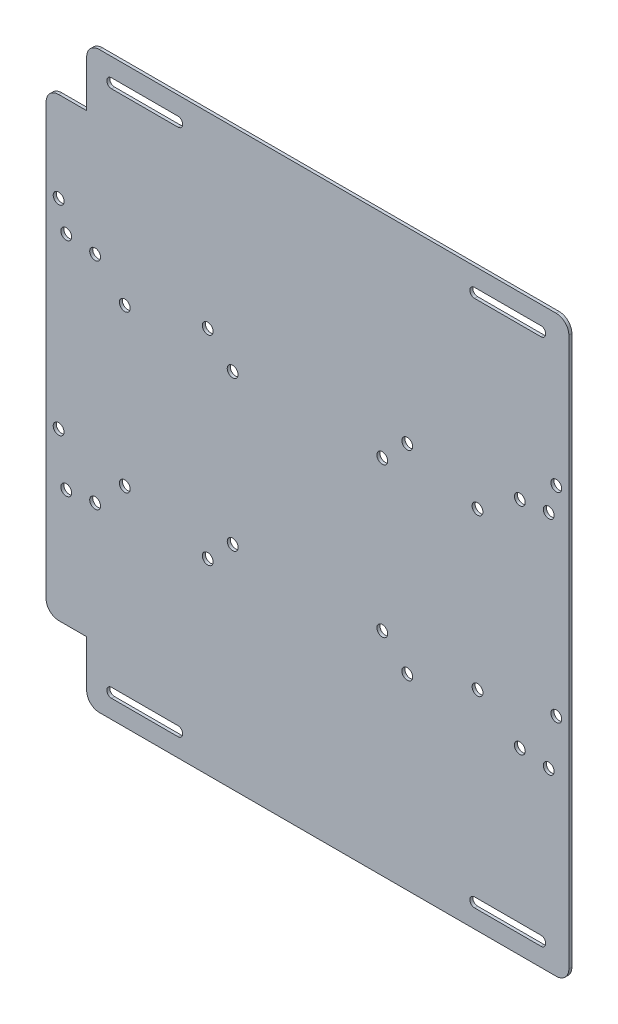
ISO-10303-21;
HEADER;
FILE_DESCRIPTION(('STEP AP214'),'2;1');
FILE_NAME('part.step','',(''),(''),'','','');
FILE_SCHEMA(('AUTOMOTIVE_DESIGN { 1 0 10303 214 1 1 1 1 }'));
ENDSEC;
DATA;
#1=APPLICATION_CONTEXT('core data for automotive mechanical design processes');
#2=APPLICATION_PROTOCOL_DEFINITION('international standard','automotive_design',2000,#1);
#3=PRODUCT_CONTEXT('',#1,'mechanical');
#4=PRODUCT('Part','Part','',(#3));
#5=PRODUCT_RELATED_PRODUCT_CATEGORY('part','',(#4));
#6=PRODUCT_DEFINITION_FORMATION('','',#4);
#7=PRODUCT_DEFINITION_CONTEXT('part definition',#1,'design');
#8=PRODUCT_DEFINITION('design','',#6,#7);
#9=PRODUCT_DEFINITION_SHAPE('','',#8);
#10=(LENGTH_UNIT() NAMED_UNIT(*) SI_UNIT(.MILLI.,.METRE.));
#11=(NAMED_UNIT(*) PLANE_ANGLE_UNIT() SI_UNIT($,.RADIAN.));
#12=(NAMED_UNIT(*) SI_UNIT($,.STERADIAN.) SOLID_ANGLE_UNIT());
#13=UNCERTAINTY_MEASURE_WITH_UNIT(LENGTH_MEASURE(1.E-05),#10,'distance_accuracy_value','');
#14=(GEOMETRIC_REPRESENTATION_CONTEXT(3) GLOBAL_UNCERTAINTY_ASSIGNED_CONTEXT((#13)) GLOBAL_UNIT_ASSIGNED_CONTEXT((#10,
#11,#12)) REPRESENTATION_CONTEXT('',''));
#15=CARTESIAN_POINT('',(0.,0.,0.));
#16=DIRECTION('',(0.,0.,1.));
#17=DIRECTION('',(1.,0.,0.));
#18=AXIS2_PLACEMENT_3D('',#15,#16,#17);
#19=CARTESIAN_POINT('',(505.9815486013,430.42629544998,-1.51892));
#20=DIRECTION('',(0.,0.,1.));
#21=DIRECTION('',(1.,0.,0.));
#22=AXIS2_PLACEMENT_3D('',#19,#20,#21);
#23=CYLINDRICAL_SURFACE('',#22,6.34999999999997);
#24=CARTESIAN_POINT('',(505.9815486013,430.42629544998,0.));
#25=DIRECTION('',(0.,0.,1.));
#26=DIRECTION('',(1.,0.,0.));
#27=AXIS2_PLACEMENT_3D('',#24,#25,#26);
#28=CIRCLE('',#27,6.34999999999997);
#29=CARTESIAN_POINT('',(512.3315486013,430.42629544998,0.));
#30=VERTEX_POINT('',#29);
#31=CARTESIAN_POINT('',(505.9815486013,436.77629544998,0.));
#32=VERTEX_POINT('',#31);
#33=EDGE_CURVE('E507',#30,#32,#28,.T.);
#34=ORIENTED_EDGE('',*,*,#33,.F.);
#35=DIRECTION('',(0.,0.,1.));
#36=VECTOR('',#35,1.);
#37=CARTESIAN_POINT('',(512.3315486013,430.42629544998,-1.51892));
#38=LINE('',#37,#36);
#39=CARTESIAN_POINT('',(512.3315486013,430.42629544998,-1.51892));
#40=VERTEX_POINT('',#39);
#41=EDGE_CURVE('E11',#40,#30,#38,.T.);
#42=ORIENTED_EDGE('',*,*,#41,.F.);
#43=CARTESIAN_POINT('',(505.9815486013,430.42629544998,-1.51892));
#44=DIRECTION('',(0.,0.,1.));
#45=DIRECTION('',(1.,0.,0.));
#46=AXIS2_PLACEMENT_3D('',#43,#44,#45);
#47=CIRCLE('',#46,6.34999999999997);
#48=CARTESIAN_POINT('',(505.9815486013,436.77629544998,-1.51892));
#49=VERTEX_POINT('',#48);
#50=EDGE_CURVE('E510',#40,#49,#47,.T.);
#51=ORIENTED_EDGE('',*,*,#50,.T.);
#52=DIRECTION('',(0.,0.,1.));
#53=VECTOR('',#52,1.);
#54=CARTESIAN_POINT('',(505.9815486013,436.77629544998,-1.51892));
#55=LINE('',#54,#53);
#56=EDGE_CURVE('E39',#49,#32,#55,.T.);
#57=ORIENTED_EDGE('',*,*,#56,.T.);
#58=EDGE_LOOP('',(#34,#42,#51,#57));
#59=FACE_BOUND('',#58,.T.);
#60=ADVANCED_FACE('F36',(#59),#23,.T.);
#61=CARTESIAN_POINT('',(512.3315486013,430.42629544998,-1.51892));
#62=DIRECTION('',(1.,0.,0.));
#63=DIRECTION('',(0.,0.,-1.));
#64=AXIS2_PLACEMENT_3D('',#61,#62,#63);
#65=PLANE('',#64);
#66=DIRECTION('',(0.,1.,0.));
#67=VECTOR('',#66,1.);
#68=CARTESIAN_POINT('',(512.3315486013,430.42629544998,0.));
#69=LINE('',#68,#67);
#70=CARTESIAN_POINT('',(512.3315486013,155.34429544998,0.));
#71=VERTEX_POINT('',#70);
#72=EDGE_CURVE('E514',#71,#30,#69,.T.);
#73=ORIENTED_EDGE('',*,*,#72,.F.);
#74=DIRECTION('',(0.,0.,1.));
#75=VECTOR('',#74,1.);
#76=CARTESIAN_POINT('',(512.3315486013,155.34429544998,-1.51892));
#77=LINE('',#76,#75);
#78=CARTESIAN_POINT('',(512.3315486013,155.34429544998,-1.51892));
#79=VERTEX_POINT('',#78);
#80=EDGE_CURVE('E44',#79,#71,#77,.T.);
#81=ORIENTED_EDGE('',*,*,#80,.F.);
#82=DIRECTION('',(0.,1.,0.));
#83=VECTOR('',#82,1.);
#84=CARTESIAN_POINT('',(512.3315486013,430.42629544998,-1.51892));
#85=LINE('',#84,#83);
#86=EDGE_CURVE('E550',#79,#40,#85,.T.);
#87=ORIENTED_EDGE('',*,*,#86,.T.);
#88=ORIENTED_EDGE('',*,*,#41,.T.);
#89=EDGE_LOOP('',(#73,#81,#87,#88));
#90=FACE_BOUND('',#89,.T.);
#91=ADVANCED_FACE('F627',(#90),#65,.T.);
#92=CARTESIAN_POINT('',(505.9815486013,155.34429544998,-1.51892));
#93=DIRECTION('',(0.,0.,1.));
#94=DIRECTION('',(1.,0.,0.));
#95=AXIS2_PLACEMENT_3D('',#92,#93,#94);
#96=CYLINDRICAL_SURFACE('',#95,6.34999999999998);
#97=CARTESIAN_POINT('',(505.9815486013,155.34429544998,0.));
#98=DIRECTION('',(0.,0.,1.));
#99=DIRECTION('',(1.,0.,0.));
#100=AXIS2_PLACEMENT_3D('',#97,#98,#99);
#101=CIRCLE('',#100,6.34999999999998);
#102=CARTESIAN_POINT('',(505.9815486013,148.99429544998,0.));
#103=VERTEX_POINT('',#102);
#104=EDGE_CURVE('E588',#103,#71,#101,.T.);
#105=ORIENTED_EDGE('',*,*,#104,.F.);
#106=DIRECTION('',(0.,0.,1.));
#107=VECTOR('',#106,1.);
#108=CARTESIAN_POINT('',(505.9815486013,148.99429544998,-1.51892));
#109=LINE('',#108,#107);
#110=CARTESIAN_POINT('',(505.9815486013,148.99429544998,-1.51892));
#111=VERTEX_POINT('',#110);
#112=EDGE_CURVE('E594',#111,#103,#109,.T.);
#113=ORIENTED_EDGE('',*,*,#112,.F.);
#114=CARTESIAN_POINT('',(505.9815486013,155.34429544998,-1.51892));
#115=DIRECTION('',(0.,0.,1.));
#116=DIRECTION('',(1.,0.,0.));
#117=AXIS2_PLACEMENT_3D('',#114,#115,#116);
#118=CIRCLE('',#117,6.34999999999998);
#119=EDGE_CURVE('E547',#111,#79,#118,.T.);
#120=ORIENTED_EDGE('',*,*,#119,.T.);
#121=ORIENTED_EDGE('',*,*,#80,.T.);
#122=EDGE_LOOP('',(#105,#113,#120,#121));
#123=FACE_BOUND('',#122,.T.);
#124=ADVANCED_FACE('F671',(#123),#96,.T.);
#125=CARTESIAN_POINT('',(277.0259486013,148.99429544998,-1.51892));
#126=DIRECTION('',(0.,-1.,0.));
#127=DIRECTION('',(0.,0.,-1.));
#128=AXIS2_PLACEMENT_3D('',#125,#126,#127);
#129=PLANE('',#128);
#130=DIRECTION('',(1.,0.,0.));
#131=VECTOR('',#130,1.);
#132=CARTESIAN_POINT('',(277.0259486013,148.99429544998,0.));
#133=LINE('',#132,#131);
#134=CARTESIAN_POINT('',(277.0259486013,148.99429544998,0.));
#135=VERTEX_POINT('',#134);
#136=EDGE_CURVE('E585',#135,#103,#133,.T.);
#137=ORIENTED_EDGE('',*,*,#136,.F.);
#138=DIRECTION('',(0.,0.,1.));
#139=VECTOR('',#138,1.);
#140=CARTESIAN_POINT('',(277.0259486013,148.99429544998,-1.51892));
#141=LINE('',#140,#139);
#142=CARTESIAN_POINT('',(277.0259486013,148.99429544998,-1.51892));
#143=VERTEX_POINT('',#142);
#144=EDGE_CURVE('E596',#143,#135,#141,.T.);
#145=ORIENTED_EDGE('',*,*,#144,.F.);
#146=DIRECTION('',(1.,0.,0.));
#147=VECTOR('',#146,1.);
#148=CARTESIAN_POINT('',(277.0259486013,148.99429544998,-1.51892));
#149=LINE('',#148,#147);
#150=EDGE_CURVE('E544',#143,#111,#149,.T.);
#151=ORIENTED_EDGE('',*,*,#150,.T.);
#152=ORIENTED_EDGE('',*,*,#112,.T.);
#153=EDGE_LOOP('',(#137,#145,#151,#152));
#154=FACE_BOUND('',#153,.T.);
#155=ADVANCED_FACE('F669',(#154),#129,.T.);
#156=CARTESIAN_POINT('',(277.0259486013,155.34429544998,-1.51892));
#157=DIRECTION('',(0.,0.,1.));
#158=DIRECTION('',(1.,0.,0.));
#159=AXIS2_PLACEMENT_3D('',#156,#157,#158);
#160=CYLINDRICAL_SURFACE('',#159,6.34999999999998);
#161=CARTESIAN_POINT('',(277.0259486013,155.34429544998,0.));
#162=DIRECTION('',(0.,0.,1.));
#163=DIRECTION('',(1.,0.,0.));
#164=AXIS2_PLACEMENT_3D('',#161,#162,#163);
#165=CIRCLE('',#164,6.34999999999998);
#166=CARTESIAN_POINT('',(270.6759486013,155.34429544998,0.));
#167=VERTEX_POINT('',#166);
#168=EDGE_CURVE('E582',#167,#135,#165,.T.);
#169=ORIENTED_EDGE('',*,*,#168,.F.);
#170=DIRECTION('',(0.,0.,1.));
#171=VECTOR('',#170,1.);
#172=CARTESIAN_POINT('',(270.6759486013,155.34429544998,-1.51892));
#173=LINE('',#172,#171);
#174=CARTESIAN_POINT('',(270.6759486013,155.34429544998,-1.51892));
#175=VERTEX_POINT('',#174);
#176=EDGE_CURVE('E598',#175,#167,#173,.T.);
#177=ORIENTED_EDGE('',*,*,#176,.F.);
#178=CARTESIAN_POINT('',(277.0259486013,155.34429544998,-1.51892));
#179=DIRECTION('',(0.,0.,1.));
#180=DIRECTION('',(1.,0.,0.));
#181=AXIS2_PLACEMENT_3D('',#178,#179,#180);
#182=CIRCLE('',#181,6.34999999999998);
#183=EDGE_CURVE('E541',#175,#143,#182,.T.);
#184=ORIENTED_EDGE('',*,*,#183,.T.);
#185=ORIENTED_EDGE('',*,*,#144,.T.);
#186=EDGE_LOOP('',(#169,#177,#184,#185));
#187=FACE_BOUND('',#186,.T.);
#188=ADVANCED_FACE('F665',(#187),#160,.T.);
#189=CARTESIAN_POINT('',(270.6759486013,155.34429544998,-1.51892));
#190=DIRECTION('',(-1.,0.,0.));
#191=DIRECTION('',(0.,0.,1.));
#192=AXIS2_PLACEMENT_3D('',#189,#190,#191);
#193=PLANE('',#192);
#194=DIRECTION('',(0.,-1.,0.));
#195=VECTOR('',#194,1.);
#196=CARTESIAN_POINT('',(270.6759486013,155.34429544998,0.));
#197=LINE('',#196,#195);
#198=CARTESIAN_POINT('',(270.6759486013,178.71229544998,0.));
#199=VERTEX_POINT('',#198);
#200=EDGE_CURVE('E579',#199,#167,#197,.T.);
#201=ORIENTED_EDGE('',*,*,#200,.F.);
#202=DIRECTION('',(0.,0.,1.));
#203=VECTOR('',#202,1.);
#204=CARTESIAN_POINT('',(270.6759486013,178.71229544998,-1.51892));
#205=LINE('',#204,#203);
#206=CARTESIAN_POINT('',(270.6759486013,178.71229544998,-1.51892));
#207=VERTEX_POINT('',#206);
#208=EDGE_CURVE('E600',#207,#199,#205,.T.);
#209=ORIENTED_EDGE('',*,*,#208,.F.);
#210=DIRECTION('',(0.,-1.,0.));
#211=VECTOR('',#210,1.);
#212=CARTESIAN_POINT('',(270.6759486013,155.34429544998,-1.51892));
#213=LINE('',#212,#211);
#214=EDGE_CURVE('E538',#207,#175,#213,.T.);
#215=ORIENTED_EDGE('',*,*,#214,.T.);
#216=ORIENTED_EDGE('',*,*,#176,.T.);
#217=EDGE_LOOP('',(#201,#209,#215,#216));
#218=FACE_BOUND('',#217,.T.);
#219=ADVANCED_FACE('F661',(#218),#193,.T.);
#220=CARTESIAN_POINT('',(256.7059486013,178.71229544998,-1.51892));
#221=DIRECTION('',(0.,-1.,0.));
#222=DIRECTION('',(0.,0.,-1.));
#223=AXIS2_PLACEMENT_3D('',#220,#221,#222);
#224=PLANE('',#223);
#225=DIRECTION('',(1.,0.,0.));
#226=VECTOR('',#225,1.);
#227=CARTESIAN_POINT('',(256.7059486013,178.71229544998,0.));
#228=LINE('',#227,#226);
#229=CARTESIAN_POINT('',(256.7059486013,178.71229544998,0.));
#230=VERTEX_POINT('',#229);
#231=EDGE_CURVE('E576',#230,#199,#228,.T.);
#232=ORIENTED_EDGE('',*,*,#231,.F.);
#233=DIRECTION('',(0.,0.,1.));
#234=VECTOR('',#233,1.);
#235=CARTESIAN_POINT('',(256.7059486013,178.71229544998,-1.51892));
#236=LINE('',#235,#234);
#237=CARTESIAN_POINT('',(256.7059486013,178.71229544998,-1.51892));
#238=VERTEX_POINT('',#237);
#239=EDGE_CURVE('E602',#238,#230,#236,.T.);
#240=ORIENTED_EDGE('',*,*,#239,.F.);
#241=DIRECTION('',(1.,0.,0.));
#242=VECTOR('',#241,1.);
#243=CARTESIAN_POINT('',(256.7059486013,178.71229544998,-1.51892));
#244=LINE('',#243,#242);
#245=EDGE_CURVE('E535',#238,#207,#244,.T.);
#246=ORIENTED_EDGE('',*,*,#245,.T.);
#247=ORIENTED_EDGE('',*,*,#208,.T.);
#248=EDGE_LOOP('',(#232,#240,#246,#247));
#249=FACE_BOUND('',#248,.T.);
#250=ADVANCED_FACE('F657',(#249),#224,.T.);
#251=CARTESIAN_POINT('',(256.7059486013,185.06229544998,-1.51892));
#252=DIRECTION('',(0.,0.,1.));
#253=DIRECTION('',(1.,0.,0.));
#254=AXIS2_PLACEMENT_3D('',#251,#252,#253);
#255=CYLINDRICAL_SURFACE('',#254,6.35000000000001);
#256=CARTESIAN_POINT('',(256.7059486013,185.06229544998,0.));
#257=DIRECTION('',(0.,0.,1.));
#258=DIRECTION('',(1.,0.,0.));
#259=AXIS2_PLACEMENT_3D('',#256,#257,#258);
#260=CIRCLE('',#259,6.35000000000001);
#261=CARTESIAN_POINT('',(250.3559486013,185.06229544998,0.));
#262=VERTEX_POINT('',#261);
#263=EDGE_CURVE('E573',#262,#230,#260,.T.);
#264=ORIENTED_EDGE('',*,*,#263,.F.);
#265=DIRECTION('',(0.,0.,1.));
#266=VECTOR('',#265,1.);
#267=CARTESIAN_POINT('',(250.3559486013,185.06229544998,-1.51892));
#268=LINE('',#267,#266);
#269=CARTESIAN_POINT('',(250.3559486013,185.06229544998,-1.51892));
#270=VERTEX_POINT('',#269);
#271=EDGE_CURVE('E604',#270,#262,#268,.T.);
#272=ORIENTED_EDGE('',*,*,#271,.F.);
#273=CARTESIAN_POINT('',(256.7059486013,185.06229544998,-1.51892));
#274=DIRECTION('',(0.,0.,1.));
#275=DIRECTION('',(1.,0.,0.));
#276=AXIS2_PLACEMENT_3D('',#273,#274,#275);
#277=CIRCLE('',#276,6.35000000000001);
#278=EDGE_CURVE('E532',#270,#238,#277,.T.);
#279=ORIENTED_EDGE('',*,*,#278,.T.);
#280=ORIENTED_EDGE('',*,*,#239,.T.);
#281=EDGE_LOOP('',(#264,#272,#279,#280));
#282=FACE_BOUND('',#281,.T.);
#283=ADVANCED_FACE('F653',(#282),#255,.T.);
#284=CARTESIAN_POINT('',(250.3559486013,400.70829544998,-1.51892));
#285=DIRECTION('',(-1.,0.,0.));
#286=DIRECTION('',(0.,0.,1.));
#287=AXIS2_PLACEMENT_3D('',#284,#285,#286);
#288=PLANE('',#287);
#289=DIRECTION('',(0.,-1.,0.));
#290=VECTOR('',#289,1.);
#291=CARTESIAN_POINT('',(250.3559486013,400.70829544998,0.));
#292=LINE('',#291,#290);
#293=CARTESIAN_POINT('',(250.3559486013,400.70829544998,0.));
#294=VERTEX_POINT('',#293);
#295=EDGE_CURVE('E570',#294,#262,#292,.T.);
#296=ORIENTED_EDGE('',*,*,#295,.F.);
#297=DIRECTION('',(0.,0.,1.));
#298=VECTOR('',#297,1.);
#299=CARTESIAN_POINT('',(250.3559486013,400.70829544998,-1.51892));
#300=LINE('',#299,#298);
#301=CARTESIAN_POINT('',(250.3559486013,400.70829544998,-1.51892));
#302=VERTEX_POINT('',#301);
#303=EDGE_CURVE('E606',#302,#294,#300,.T.);
#304=ORIENTED_EDGE('',*,*,#303,.F.);
#305=DIRECTION('',(0.,-1.,0.));
#306=VECTOR('',#305,1.);
#307=CARTESIAN_POINT('',(250.3559486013,400.70829544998,-1.51892));
#308=LINE('',#307,#306);
#309=EDGE_CURVE('E529',#302,#270,#308,.T.);
#310=ORIENTED_EDGE('',*,*,#309,.T.);
#311=ORIENTED_EDGE('',*,*,#271,.T.);
#312=EDGE_LOOP('',(#296,#304,#310,#311));
#313=FACE_BOUND('',#312,.T.);
#314=ADVANCED_FACE('F649',(#313),#288,.T.);
#315=CARTESIAN_POINT('',(256.7059486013,400.70829544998,-1.51892));
#316=DIRECTION('',(0.,0.,1.));
#317=DIRECTION('',(1.,0.,0.));
#318=AXIS2_PLACEMENT_3D('',#315,#316,#317);
#319=CYLINDRICAL_SURFACE('',#318,6.34999999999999);
#320=CARTESIAN_POINT('',(256.7059486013,400.70829544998,0.));
#321=DIRECTION('',(0.,0.,1.));
#322=DIRECTION('',(1.,0.,0.));
#323=AXIS2_PLACEMENT_3D('',#320,#321,#322);
#324=CIRCLE('',#323,6.34999999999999);
#325=CARTESIAN_POINT('',(256.7059486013,407.05829544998,0.));
#326=VERTEX_POINT('',#325);
#327=EDGE_CURVE('E567',#326,#294,#324,.T.);
#328=ORIENTED_EDGE('',*,*,#327,.F.);
#329=DIRECTION('',(0.,0.,1.));
#330=VECTOR('',#329,1.);
#331=CARTESIAN_POINT('',(256.7059486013,407.05829544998,-1.51892));
#332=LINE('',#331,#330);
#333=CARTESIAN_POINT('',(256.7059486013,407.05829544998,-1.51892));
#334=VERTEX_POINT('',#333);
#335=EDGE_CURVE('E608',#334,#326,#332,.T.);
#336=ORIENTED_EDGE('',*,*,#335,.F.);
#337=CARTESIAN_POINT('',(256.7059486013,400.70829544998,-1.51892));
#338=DIRECTION('',(0.,0.,1.));
#339=DIRECTION('',(1.,0.,0.));
#340=AXIS2_PLACEMENT_3D('',#337,#338,#339);
#341=CIRCLE('',#340,6.34999999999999);
#342=EDGE_CURVE('E526',#334,#302,#341,.T.);
#343=ORIENTED_EDGE('',*,*,#342,.T.);
#344=ORIENTED_EDGE('',*,*,#303,.T.);
#345=EDGE_LOOP('',(#328,#336,#343,#344));
#346=FACE_BOUND('',#345,.T.);
#347=ADVANCED_FACE('F645',(#346),#319,.T.);
#348=CARTESIAN_POINT('',(256.7059486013,407.05829544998,-1.51892));
#349=DIRECTION('',(0.,1.,0.));
#350=DIRECTION('',(0.,0.,1.));
#351=AXIS2_PLACEMENT_3D('',#348,#349,#350);
#352=PLANE('',#351);
#353=DIRECTION('',(-1.,0.,0.));
#354=VECTOR('',#353,1.);
#355=CARTESIAN_POINT('',(256.7059486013,407.05829544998,0.));
#356=LINE('',#355,#354);
#357=CARTESIAN_POINT('',(270.6759486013,407.05829544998,0.));
#358=VERTEX_POINT('',#357);
#359=EDGE_CURVE('E564',#358,#326,#356,.T.);
#360=ORIENTED_EDGE('',*,*,#359,.F.);
#361=DIRECTION('',(0.,0.,1.));
#362=VECTOR('',#361,1.);
#363=CARTESIAN_POINT('',(270.6759486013,407.05829544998,-1.51892));
#364=LINE('',#363,#362);
#365=CARTESIAN_POINT('',(270.6759486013,407.05829544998,-1.51892));
#366=VERTEX_POINT('',#365);
#367=EDGE_CURVE('E610',#366,#358,#364,.T.);
#368=ORIENTED_EDGE('',*,*,#367,.F.);
#369=DIRECTION('',(-1.,0.,0.));
#370=VECTOR('',#369,1.);
#371=CARTESIAN_POINT('',(256.7059486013,407.05829544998,-1.51892));
#372=LINE('',#371,#370);
#373=EDGE_CURVE('E523',#366,#334,#372,.T.);
#374=ORIENTED_EDGE('',*,*,#373,.T.);
#375=ORIENTED_EDGE('',*,*,#335,.T.);
#376=EDGE_LOOP('',(#360,#368,#374,#375));
#377=FACE_BOUND('',#376,.T.);
#378=ADVANCED_FACE('F641',(#377),#352,.T.);
#379=CARTESIAN_POINT('',(270.6759486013,430.42629544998,-1.51892));
#380=DIRECTION('',(-1.,0.,0.));
#381=DIRECTION('',(0.,0.,1.));
#382=AXIS2_PLACEMENT_3D('',#379,#380,#381);
#383=PLANE('',#382);
#384=DIRECTION('',(0.,-1.,0.));
#385=VECTOR('',#384,1.);
#386=CARTESIAN_POINT('',(270.6759486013,430.42629544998,0.));
#387=LINE('',#386,#385);
#388=CARTESIAN_POINT('',(270.6759486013,430.42629544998,0.));
#389=VERTEX_POINT('',#388);
#390=EDGE_CURVE('E561',#389,#358,#387,.T.);
#391=ORIENTED_EDGE('',*,*,#390,.F.);
#392=DIRECTION('',(0.,0.,1.));
#393=VECTOR('',#392,1.);
#394=CARTESIAN_POINT('',(270.6759486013,430.42629544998,-1.51892));
#395=LINE('',#394,#393);
#396=CARTESIAN_POINT('',(270.6759486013,430.42629544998,-1.51892));
#397=VERTEX_POINT('',#396);
#398=EDGE_CURVE('E612',#397,#389,#395,.T.);
#399=ORIENTED_EDGE('',*,*,#398,.F.);
#400=DIRECTION('',(0.,-1.,0.));
#401=VECTOR('',#400,1.);
#402=CARTESIAN_POINT('',(270.6759486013,430.42629544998,-1.51892));
#403=LINE('',#402,#401);
#404=EDGE_CURVE('E520',#397,#366,#403,.T.);
#405=ORIENTED_EDGE('',*,*,#404,.T.);
#406=ORIENTED_EDGE('',*,*,#367,.T.);
#407=EDGE_LOOP('',(#391,#399,#405,#406));
#408=FACE_BOUND('',#407,.T.);
#409=ADVANCED_FACE('F639',(#408),#383,.T.);
#410=CARTESIAN_POINT('',(277.0259486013,430.42629544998,-1.51892));
#411=DIRECTION('',(0.,0.,1.));
#412=DIRECTION('',(1.,0.,0.));
#413=AXIS2_PLACEMENT_3D('',#410,#411,#412);
#414=CYLINDRICAL_SURFACE('',#413,6.34999999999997);
#415=CARTESIAN_POINT('',(277.0259486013,430.42629544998,0.));
#416=DIRECTION('',(0.,0.,1.));
#417=DIRECTION('',(1.,0.,0.));
#418=AXIS2_PLACEMENT_3D('',#415,#416,#417);
#419=CIRCLE('',#418,6.34999999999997);
#420=CARTESIAN_POINT('',(277.0259486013,436.77629544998,0.));
#421=VERTEX_POINT('',#420);
#422=EDGE_CURVE('E558',#421,#389,#419,.T.);
#423=ORIENTED_EDGE('',*,*,#422,.F.);
#424=DIRECTION('',(0.,0.,1.));
#425=VECTOR('',#424,1.);
#426=CARTESIAN_POINT('',(277.0259486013,436.77629544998,-1.51892));
#427=LINE('',#426,#425);
#428=CARTESIAN_POINT('',(277.0259486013,436.77629544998,-1.51892));
#429=VERTEX_POINT('',#428);
#430=EDGE_CURVE('E613',#429,#421,#427,.T.);
#431=ORIENTED_EDGE('',*,*,#430,.F.);
#432=CARTESIAN_POINT('',(277.0259486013,430.42629544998,-1.51892));
#433=DIRECTION('',(0.,0.,1.));
#434=DIRECTION('',(1.,0.,0.));
#435=AXIS2_PLACEMENT_3D('',#432,#433,#434);
#436=CIRCLE('',#435,6.34999999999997);
#437=EDGE_CURVE('E517',#429,#397,#436,.T.);
#438=ORIENTED_EDGE('',*,*,#437,.T.);
#439=ORIENTED_EDGE('',*,*,#398,.T.);
#440=EDGE_LOOP('',(#423,#431,#438,#439));
#441=FACE_BOUND('',#440,.T.);
#442=ADVANCED_FACE('F635',(#441),#414,.T.);
#443=CARTESIAN_POINT('',(277.0259486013,436.77629544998,-1.51892));
#444=DIRECTION('',(0.,1.,0.));
#445=DIRECTION('',(0.,0.,1.));
#446=AXIS2_PLACEMENT_3D('',#443,#444,#445);
#447=PLANE('',#446);
#448=DIRECTION('',(-1.,0.,0.));
#449=VECTOR('',#448,1.);
#450=CARTESIAN_POINT('',(277.0259486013,436.77629544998,0.));
#451=LINE('',#450,#449);
#452=EDGE_CURVE('E555',#32,#421,#451,.T.);
#453=ORIENTED_EDGE('',*,*,#452,.F.);
#454=ORIENTED_EDGE('',*,*,#56,.F.);
#455=DIRECTION('',(-1.,0.,0.));
#456=VECTOR('',#455,1.);
#457=CARTESIAN_POINT('',(277.0259486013,436.77629544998,-1.51892));
#458=LINE('',#457,#456);
#459=EDGE_CURVE('E513',#49,#429,#458,.T.);
#460=ORIENTED_EDGE('',*,*,#459,.T.);
#461=ORIENTED_EDGE('',*,*,#430,.T.);
#462=EDGE_LOOP('',(#453,#454,#460,#461));
#463=FACE_BOUND('',#462,.T.);
#464=ADVANCED_FACE('F621',(#463),#447,.T.);
#465=CARTESIAN_POINT('',(505.9815486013,430.42629544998,-1.51892));
#466=DIRECTION('',(0.,0.,1.));
#467=DIRECTION('',(1.,0.,0.));
#468=AXIS2_PLACEMENT_3D('',#465,#466,#467);
#469=PLANE('',#468);
#470=DIRECTION('',(-1.,0.,0.));
#471=VECTOR('',#470,1.);
#472=CARTESIAN_POINT('',(465.08416063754,427.5472489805,-1.51892));
#473=LINE('',#472,#471);
#474=CARTESIAN_POINT('',(498.35816073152,427.5472489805,-1.51892));
#475=VERTEX_POINT('',#474);
#476=CARTESIAN_POINT('',(465.08416063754,427.5472489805,-1.51892));
#477=VERTEX_POINT('',#476);
#478=EDGE_CURVE('E241',#475,#477,#473,.T.);
#479=ORIENTED_EDGE('',*,*,#478,.T.);
#480=CARTESIAN_POINT('',(465.08416063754,425.1596489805,-1.51892));
#481=DIRECTION('',(0.,0.,1.));
#482=DIRECTION('',(1.,0.,0.));
#483=AXIS2_PLACEMENT_3D('',#480,#481,#482);
#484=CIRCLE('',#483,2.38759999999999);
#485=CARTESIAN_POINT('',(465.08416063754,422.7720489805,-1.51892));
#486=VERTEX_POINT('',#485);
#487=EDGE_CURVE('E235',#477,#486,#484,.T.);
#488=ORIENTED_EDGE('',*,*,#487,.T.);
#489=DIRECTION('',(1.,0.,0.));
#490=VECTOR('',#489,1.);
#491=CARTESIAN_POINT('',(465.08416063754,422.7720489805,-1.51892));
#492=LINE('',#491,#490);
#493=CARTESIAN_POINT('',(498.35816073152,422.7720489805,-1.51892));
#494=VERTEX_POINT('',#493);
#495=EDGE_CURVE('E244',#486,#494,#492,.T.);
#496=ORIENTED_EDGE('',*,*,#495,.T.);
#497=CARTESIAN_POINT('',(498.35816073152,425.1596489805,-1.51892));
#498=DIRECTION('',(0.,0.,1.));
#499=DIRECTION('',(1.,0.,0.));
#500=AXIS2_PLACEMENT_3D('',#497,#498,#499);
#501=CIRCLE('',#500,2.38759999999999);
#502=EDGE_CURVE('E52',#494,#475,#501,.T.);
#503=ORIENTED_EDGE('',*,*,#502,.T.);
#504=EDGE_LOOP('',(#479,#488,#496,#503));
#505=FACE_BOUND('',#504,.T.);
#506=DIRECTION('',(-1.,0.,0.));
#507=VECTOR('',#506,1.);
#508=CARTESIAN_POINT('',(283.1480891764,427.5472489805,-1.51892));
#509=LINE('',#508,#507);
#510=CARTESIAN_POINT('',(316.42208927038,427.5472489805,-1.51892));
#511=VERTEX_POINT('',#510);
#512=CARTESIAN_POINT('',(283.1480891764,427.5472489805,-1.51892));
#513=VERTEX_POINT('',#512);
#514=EDGE_CURVE('E280',#511,#513,#509,.T.);
#515=ORIENTED_EDGE('',*,*,#514,.T.);
#516=CARTESIAN_POINT('',(283.1480891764,425.1596489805,-1.51892));
#517=DIRECTION('',(0.,0.,1.));
#518=DIRECTION('',(1.,0.,0.));
#519=AXIS2_PLACEMENT_3D('',#516,#517,#518);
#520=CIRCLE('',#519,2.38759999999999);
#521=CARTESIAN_POINT('',(283.1480891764,422.7720489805,-1.51892));
#522=VERTEX_POINT('',#521);
#523=EDGE_CURVE('E270',#513,#522,#520,.T.);
#524=ORIENTED_EDGE('',*,*,#523,.T.);
#525=DIRECTION('',(1.,0.,0.));
#526=VECTOR('',#525,1.);
#527=CARTESIAN_POINT('',(283.1480891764,422.7720489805,-1.51892));
#528=LINE('',#527,#526);
#529=CARTESIAN_POINT('',(316.42208927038,422.7720489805,-1.51892));
#530=VERTEX_POINT('',#529);
#531=EDGE_CURVE('E273',#522,#530,#528,.T.);
#532=ORIENTED_EDGE('',*,*,#531,.T.);
#533=CARTESIAN_POINT('',(316.42208927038,425.1596489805,-1.51892));
#534=DIRECTION('',(0.,0.,1.));
#535=DIRECTION('',(1.,0.,0.));
#536=AXIS2_PLACEMENT_3D('',#533,#534,#535);
#537=CIRCLE('',#536,2.38759999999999);
#538=EDGE_CURVE('E277',#530,#511,#537,.T.);
#539=ORIENTED_EDGE('',*,*,#538,.T.);
#540=EDGE_LOOP('',(#515,#524,#532,#539));
#541=FACE_BOUND('',#540,.T.);
#542=DIRECTION('',(-1.,0.,0.));
#543=VECTOR('',#542,1.);
#544=CARTESIAN_POINT('',(465.08416063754,162.99854143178,-1.51892));
#545=LINE('',#544,#543);
#546=CARTESIAN_POINT('',(498.35816073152,162.99854143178,-1.51892));
#547=VERTEX_POINT('',#546);
#548=CARTESIAN_POINT('',(465.08416063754,162.99854143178,-1.51892));
#549=VERTEX_POINT('',#548);
#550=EDGE_CURVE('E312',#547,#549,#545,.T.);
#551=ORIENTED_EDGE('',*,*,#550,.T.);
#552=CARTESIAN_POINT('',(465.08416063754,160.61094143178,-1.51892));
#553=DIRECTION('',(0.,0.,1.));
#554=DIRECTION('',(1.,0.,0.));
#555=AXIS2_PLACEMENT_3D('',#552,#553,#554);
#556=CIRCLE('',#555,2.3876);
#557=CARTESIAN_POINT('',(465.08416063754,158.22334143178,-1.51892));
#558=VERTEX_POINT('',#557);
#559=EDGE_CURVE('E302',#549,#558,#556,.T.);
#560=ORIENTED_EDGE('',*,*,#559,.T.);
#561=DIRECTION('',(1.,0.,0.));
#562=VECTOR('',#561,1.);
#563=CARTESIAN_POINT('',(465.08416063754,158.22334143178,-1.51892));
#564=LINE('',#563,#562);
#565=CARTESIAN_POINT('',(498.35816073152,158.22334143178,-1.51892));
#566=VERTEX_POINT('',#565);
#567=EDGE_CURVE('E305',#558,#566,#564,.T.);
#568=ORIENTED_EDGE('',*,*,#567,.T.);
#569=CARTESIAN_POINT('',(498.35816073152,160.61094143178,-1.51892));
#570=DIRECTION('',(0.,0.,1.));
#571=DIRECTION('',(1.,0.,0.));
#572=AXIS2_PLACEMENT_3D('',#569,#570,#571);
#573=CIRCLE('',#572,2.3876);
#574=EDGE_CURVE('E309',#566,#547,#573,.T.);
#575=ORIENTED_EDGE('',*,*,#574,.T.);
#576=EDGE_LOOP('',(#551,#560,#568,#575));
#577=FACE_BOUND('',#576,.T.);
#578=DIRECTION('',(-1.,0.,0.));
#579=VECTOR('',#578,1.);
#580=CARTESIAN_POINT('',(283.1480891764,162.99854143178,-1.51892));
#581=LINE('',#580,#579);
#582=CARTESIAN_POINT('',(316.42208927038,162.99854143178,-1.51892));
#583=VERTEX_POINT('',#582);
#584=CARTESIAN_POINT('',(283.1480891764,162.99854143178,-1.51892));
#585=VERTEX_POINT('',#584);
#586=EDGE_CURVE('E344',#583,#585,#581,.T.);
#587=ORIENTED_EDGE('',*,*,#586,.T.);
#588=CARTESIAN_POINT('',(283.1480891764,160.61094143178,-1.51892));
#589=DIRECTION('',(0.,0.,1.));
#590=DIRECTION('',(1.,0.,0.));
#591=AXIS2_PLACEMENT_3D('',#588,#589,#590);
#592=CIRCLE('',#591,2.3876);
#593=CARTESIAN_POINT('',(283.1480891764,158.22334143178,-1.51892));
#594=VERTEX_POINT('',#593);
#595=EDGE_CURVE('E334',#585,#594,#592,.T.);
#596=ORIENTED_EDGE('',*,*,#595,.T.);
#597=DIRECTION('',(1.,0.,0.));
#598=VECTOR('',#597,1.);
#599=CARTESIAN_POINT('',(283.1480891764,158.22334143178,-1.51892));
#600=LINE('',#599,#598);
#601=CARTESIAN_POINT('',(316.42208927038,158.22334143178,-1.51892));
#602=VERTEX_POINT('',#601);
#603=EDGE_CURVE('E337',#594,#602,#600,.T.);
#604=ORIENTED_EDGE('',*,*,#603,.T.);
#605=CARTESIAN_POINT('',(316.42208927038,160.61094143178,-1.51892));
#606=DIRECTION('',(0.,0.,1.));
#607=DIRECTION('',(1.,0.,0.));
#608=AXIS2_PLACEMENT_3D('',#605,#606,#607);
#609=CIRCLE('',#608,2.3876);
#610=EDGE_CURVE('E341',#602,#583,#609,.T.);
#611=ORIENTED_EDGE('',*,*,#610,.T.);
#612=EDGE_LOOP('',(#587,#596,#604,#611));
#613=FACE_BOUND('',#612,.T.);
#614=CARTESIAN_POINT('',(256.6297486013,261.89729544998,-1.51892));
#615=DIRECTION('',(0.,0.,1.));
#616=DIRECTION('',(1.,0.,0.));
#617=AXIS2_PLACEMENT_3D('',#614,#615,#616);
#618=CIRCLE('',#617,2.71779999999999);
#619=CARTESIAN_POINT('',(259.3475486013,261.89729544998,-1.51892));
#620=VERTEX_POINT('',#619);
#621=EDGE_CURVE('E366',#620,#620,#618,.T.);
#622=ORIENTED_EDGE('',*,*,#621,.T.);
#623=EDGE_LOOP('',(#622));
#624=FACE_BOUND('',#623,.T.);
#625=CARTESIAN_POINT('',(506.0577486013,261.89729544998,-1.51892));
#626=DIRECTION('',(0.,0.,1.));
#627=DIRECTION('',(1.,0.,0.));
#628=AXIS2_PLACEMENT_3D('',#625,#626,#627);
#629=CIRCLE('',#628,2.71779999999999);
#630=CARTESIAN_POINT('',(508.7755486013,261.89729544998,-1.51892));
#631=VERTEX_POINT('',#630);
#632=EDGE_CURVE('E372',#631,#631,#629,.T.);
#633=ORIENTED_EDGE('',*,*,#632,.T.);
#634=EDGE_LOOP('',(#633));
#635=FACE_BOUND('',#634,.T.);
#636=CARTESIAN_POINT('',(506.0577486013,361.97329544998,-1.51892));
#637=DIRECTION('',(0.,0.,1.));
#638=DIRECTION('',(1.,0.,0.));
#639=AXIS2_PLACEMENT_3D('',#636,#637,#638);
#640=CIRCLE('',#639,2.71779999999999);
#641=CARTESIAN_POINT('',(508.7755486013,361.97329544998,-1.51892));
#642=VERTEX_POINT('',#641);
#643=EDGE_CURVE('E378',#642,#642,#640,.T.);
#644=ORIENTED_EDGE('',*,*,#643,.T.);
#645=EDGE_LOOP('',(#644));
#646=FACE_BOUND('',#645,.T.);
#647=CARTESIAN_POINT('',(256.6297486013,361.97329544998,-1.51892));
#648=DIRECTION('',(0.,0.,1.));
#649=DIRECTION('',(1.,0.,0.));
#650=AXIS2_PLACEMENT_3D('',#647,#648,#649);
#651=CIRCLE('',#650,2.71779999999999);
#652=CARTESIAN_POINT('',(259.3475486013,361.97329544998,-1.51892));
#653=VERTEX_POINT('',#652);
#654=EDGE_CURVE('E384',#653,#653,#651,.T.);
#655=ORIENTED_EDGE('',*,*,#654,.T.);
#656=EDGE_LOOP('',(#655));
#657=FACE_BOUND('',#656,.T.);
#658=CARTESIAN_POINT('',(260.4397486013,237.33549544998,-1.51892));
#659=DIRECTION('',(0.,0.,1.));
#660=DIRECTION('',(1.,0.,0.));
#661=AXIS2_PLACEMENT_3D('',#658,#659,#660);
#662=CIRCLE('',#661,2.71779999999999);
#663=CARTESIAN_POINT('',(263.1575486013,237.33549544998,-1.51892));
#664=VERTEX_POINT('',#663);
#665=EDGE_CURVE('E390',#664,#664,#662,.T.);
#666=ORIENTED_EDGE('',*,*,#665,.T.);
#667=EDGE_LOOP('',(#666));
#668=FACE_BOUND('',#667,.T.);
#669=CARTESIAN_POINT('',(260.4397486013,348.43509544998,-1.51892));
#670=DIRECTION('',(0.,0.,1.));
#671=DIRECTION('',(1.,0.,0.));
#672=AXIS2_PLACEMENT_3D('',#669,#670,#671);
#673=CIRCLE('',#672,2.71779999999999);
#674=CARTESIAN_POINT('',(263.1575486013,348.43509544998,-1.51892));
#675=VERTEX_POINT('',#674);
#676=EDGE_CURVE('E396',#675,#675,#673,.T.);
#677=ORIENTED_EDGE('',*,*,#676,.T.);
#678=EDGE_LOOP('',(#677));
#679=FACE_BOUND('',#678,.T.);
#680=CARTESIAN_POINT('',(502.2477486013,348.43509544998,-1.51892));
#681=DIRECTION('',(0.,0.,1.));
#682=DIRECTION('',(1.,0.,0.));
#683=AXIS2_PLACEMENT_3D('',#680,#681,#682);
#684=CIRCLE('',#683,2.71779999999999);
#685=CARTESIAN_POINT('',(504.9655486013,348.43509544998,-1.51892));
#686=VERTEX_POINT('',#685);
#687=EDGE_CURVE('E402',#686,#686,#684,.T.);
#688=ORIENTED_EDGE('',*,*,#687,.T.);
#689=EDGE_LOOP('',(#688));
#690=FACE_BOUND('',#689,.T.);
#691=CARTESIAN_POINT('',(502.2477486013,237.33549544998,-1.51892));
#692=DIRECTION('',(0.,0.,1.));
#693=DIRECTION('',(1.,0.,0.));
#694=AXIS2_PLACEMENT_3D('',#691,#692,#693);
#695=CIRCLE('',#694,2.71779999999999);
#696=CARTESIAN_POINT('',(504.9655486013,237.33549544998,-1.51892));
#697=VERTEX_POINT('',#696);
#698=EDGE_CURVE('E408',#697,#697,#695,.T.);
#699=ORIENTED_EDGE('',*,*,#698,.T.);
#700=EDGE_LOOP('',(#699));
#701=FACE_BOUND('',#700,.T.);
#702=CARTESIAN_POINT('',(487.7697486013,346.86029544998,-1.51892));
#703=DIRECTION('',(0.,0.,1.));
#704=DIRECTION('',(1.,0.,0.));
#705=AXIS2_PLACEMENT_3D('',#702,#703,#704);
#706=CIRCLE('',#705,2.71779999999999);
#707=CARTESIAN_POINT('',(490.4875486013,346.86029544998,-1.51892));
#708=VERTEX_POINT('',#707);
#709=EDGE_CURVE('E414',#708,#708,#706,.T.);
#710=ORIENTED_EDGE('',*,*,#709,.T.);
#711=EDGE_LOOP('',(#710));
#712=FACE_BOUND('',#711,.T.);
#713=CARTESIAN_POINT('',(466.5582086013,332.13591544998,-1.51892));
#714=DIRECTION('',(0.,0.,1.));
#715=DIRECTION('',(1.,0.,0.));
#716=AXIS2_PLACEMENT_3D('',#713,#714,#715);
#717=CIRCLE('',#716,2.71779999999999);
#718=CARTESIAN_POINT('',(469.2760086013,332.13591544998,-1.51892));
#719=VERTEX_POINT('',#718);
#720=EDGE_CURVE('E420',#719,#719,#717,.T.);
#721=ORIENTED_EDGE('',*,*,#720,.T.);
#722=EDGE_LOOP('',(#721));
#723=FACE_BOUND('',#722,.T.);
#724=CARTESIAN_POINT('',(487.7697486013,238.91029544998,-1.51892));
#725=DIRECTION('',(0.,0.,1.));
#726=DIRECTION('',(1.,0.,0.));
#727=AXIS2_PLACEMENT_3D('',#724,#725,#726);
#728=CIRCLE('',#727,2.71779999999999);
#729=CARTESIAN_POINT('',(490.4875486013,238.91029544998,-1.51892));
#730=VERTEX_POINT('',#729);
#731=EDGE_CURVE('E426',#730,#730,#728,.T.);
#732=ORIENTED_EDGE('',*,*,#731,.T.);
#733=EDGE_LOOP('',(#732));
#734=FACE_BOUND('',#733,.T.);
#735=CARTESIAN_POINT('',(466.5582086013,253.63467544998,-1.51892));
#736=DIRECTION('',(0.,0.,1.));
#737=DIRECTION('',(1.,0.,0.));
#738=AXIS2_PLACEMENT_3D('',#735,#736,#737);
#739=CIRCLE('',#738,2.71779999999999);
#740=CARTESIAN_POINT('',(469.2760086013,253.63467544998,-1.51892));
#741=VERTEX_POINT('',#740);
#742=EDGE_CURVE('E432',#741,#741,#739,.T.);
#743=ORIENTED_EDGE('',*,*,#742,.T.);
#744=EDGE_LOOP('',(#743));
#745=FACE_BOUND('',#744,.T.);
#746=CARTESIAN_POINT('',(274.9177486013,238.91029544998,-1.51892));
#747=DIRECTION('',(0.,0.,1.));
#748=DIRECTION('',(1.,0.,0.));
#749=AXIS2_PLACEMENT_3D('',#746,#747,#748);
#750=CIRCLE('',#749,2.71779999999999);
#751=CARTESIAN_POINT('',(277.6355486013,238.91029544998,-1.51892));
#752=VERTEX_POINT('',#751);
#753=EDGE_CURVE('E438',#752,#752,#750,.T.);
#754=ORIENTED_EDGE('',*,*,#753,.T.);
#755=EDGE_LOOP('',(#754));
#756=FACE_BOUND('',#755,.T.);
#757=CARTESIAN_POINT('',(289.7792886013,253.63467544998,-1.51892));
#758=DIRECTION('',(0.,0.,1.));
#759=DIRECTION('',(1.,0.,0.));
#760=AXIS2_PLACEMENT_3D('',#757,#758,#759);
#761=CIRCLE('',#760,2.71779999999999);
#762=CARTESIAN_POINT('',(292.4970886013,253.63467544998,-1.51892));
#763=VERTEX_POINT('',#762);
#764=EDGE_CURVE('E444',#763,#763,#761,.T.);
#765=ORIENTED_EDGE('',*,*,#764,.T.);
#766=EDGE_LOOP('',(#765));
#767=FACE_BOUND('',#766,.T.);
#768=CARTESIAN_POINT('',(274.9177486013,346.86029544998,-1.51892));
#769=DIRECTION('',(0.,0.,1.));
#770=DIRECTION('',(1.,0.,0.));
#771=AXIS2_PLACEMENT_3D('',#768,#769,#770);
#772=CIRCLE('',#771,2.71779999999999);
#773=CARTESIAN_POINT('',(277.6355486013,346.86029544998,-1.51892));
#774=VERTEX_POINT('',#773);
#775=EDGE_CURVE('E450',#774,#774,#772,.T.);
#776=ORIENTED_EDGE('',*,*,#775,.T.);
#777=EDGE_LOOP('',(#776));
#778=FACE_BOUND('',#777,.T.);
#779=CARTESIAN_POINT('',(289.7792886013,332.13591544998,-1.51892));
#780=DIRECTION('',(0.,0.,1.));
#781=DIRECTION('',(1.,0.,0.));
#782=AXIS2_PLACEMENT_3D('',#779,#780,#781);
#783=CIRCLE('',#782,2.71779999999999);
#784=CARTESIAN_POINT('',(292.4970886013,332.13591544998,-1.51892));
#785=VERTEX_POINT('',#784);
#786=EDGE_CURVE('E456',#785,#785,#783,.T.);
#787=ORIENTED_EDGE('',*,*,#786,.T.);
#788=EDGE_LOOP('',(#787));
#789=FACE_BOUND('',#788,.T.);
#790=CARTESIAN_POINT('',(331.3438486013,342.88519544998,-1.51892));
#791=DIRECTION('',(0.,0.,1.));
#792=DIRECTION('',(1.,0.,0.));
#793=AXIS2_PLACEMENT_3D('',#790,#791,#792);
#794=CIRCLE('',#793,2.71779999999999);
#795=CARTESIAN_POINT('',(334.0616486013,342.88519544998,-1.51892));
#796=VERTEX_POINT('',#795);
#797=EDGE_CURVE('E462',#796,#796,#794,.T.);
#798=ORIENTED_EDGE('',*,*,#797,.T.);
#799=EDGE_LOOP('',(#798));
#800=FACE_BOUND('',#799,.T.);
#801=CARTESIAN_POINT('',(431.3436486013,342.88519544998,-1.51892));
#802=DIRECTION('',(0.,0.,1.));
#803=DIRECTION('',(1.,0.,0.));
#804=AXIS2_PLACEMENT_3D('',#801,#802,#803);
#805=CIRCLE('',#804,2.71779999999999);
#806=CARTESIAN_POINT('',(434.0614486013,342.88519544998,-1.51892));
#807=VERTEX_POINT('',#806);
#808=EDGE_CURVE('E468',#807,#807,#805,.T.);
#809=ORIENTED_EDGE('',*,*,#808,.T.);
#810=EDGE_LOOP('',(#809));
#811=FACE_BOUND('',#810,.T.);
#812=CARTESIAN_POINT('',(431.3436486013,242.88539544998,-1.51892));
#813=DIRECTION('',(0.,0.,1.));
#814=DIRECTION('',(1.,0.,0.));
#815=AXIS2_PLACEMENT_3D('',#812,#813,#814);
#816=CIRCLE('',#815,2.71779999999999);
#817=CARTESIAN_POINT('',(434.0614486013,242.88539544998,-1.51892));
#818=VERTEX_POINT('',#817);
#819=EDGE_CURVE('E474',#818,#818,#816,.T.);
#820=ORIENTED_EDGE('',*,*,#819,.T.);
#821=EDGE_LOOP('',(#820));
#822=FACE_BOUND('',#821,.T.);
#823=CARTESIAN_POINT('',(331.3438486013,242.88539544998,-1.51892));
#824=DIRECTION('',(0.,0.,1.));
#825=DIRECTION('',(1.,0.,0.));
#826=AXIS2_PLACEMENT_3D('',#823,#824,#825);
#827=CIRCLE('',#826,2.71779999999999);
#828=CARTESIAN_POINT('',(334.0616486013,242.88539544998,-1.51892));
#829=VERTEX_POINT('',#828);
#830=EDGE_CURVE('E480',#829,#829,#827,.T.);
#831=ORIENTED_EDGE('',*,*,#830,.T.);
#832=EDGE_LOOP('',(#831));
#833=FACE_BOUND('',#832,.T.);
#834=CARTESIAN_POINT('',(418.8443086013,330.38585544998,-1.51892));
#835=DIRECTION('',(0.,0.,1.));
#836=DIRECTION('',(1.,0.,0.));
#837=AXIS2_PLACEMENT_3D('',#834,#835,#836);
#838=CIRCLE('',#837,2.71779999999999);
#839=CARTESIAN_POINT('',(421.5621086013,330.38585544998,-1.51892));
#840=VERTEX_POINT('',#839);
#841=EDGE_CURVE('E486',#840,#840,#838,.T.);
#842=ORIENTED_EDGE('',*,*,#841,.T.);
#843=EDGE_LOOP('',(#842));
#844=FACE_BOUND('',#843,.T.);
#845=CARTESIAN_POINT('',(343.8431886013,330.38585544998,-1.51892));
#846=DIRECTION('',(0.,0.,1.));
#847=DIRECTION('',(1.,0.,0.));
#848=AXIS2_PLACEMENT_3D('',#845,#846,#847);
#849=CIRCLE('',#848,2.71779999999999);
#850=CARTESIAN_POINT('',(346.5609886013,330.38585544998,-1.51892));
#851=VERTEX_POINT('',#850);
#852=EDGE_CURVE('E492',#851,#851,#849,.T.);
#853=ORIENTED_EDGE('',*,*,#852,.T.);
#854=EDGE_LOOP('',(#853));
#855=FACE_BOUND('',#854,.T.);
#856=CARTESIAN_POINT('',(343.8431886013,255.38473544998,-1.51892));
#857=DIRECTION('',(0.,0.,1.));
#858=DIRECTION('',(1.,0.,0.));
#859=AXIS2_PLACEMENT_3D('',#856,#857,#858);
#860=CIRCLE('',#859,2.71779999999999);
#861=CARTESIAN_POINT('',(346.5609886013,255.38473544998,-1.51892));
#862=VERTEX_POINT('',#861);
#863=EDGE_CURVE('E498',#862,#862,#860,.T.);
#864=ORIENTED_EDGE('',*,*,#863,.T.);
#865=EDGE_LOOP('',(#864));
#866=FACE_BOUND('',#865,.T.);
#867=CARTESIAN_POINT('',(418.8443086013,255.38473544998,-1.51892));
#868=DIRECTION('',(0.,0.,1.));
#869=DIRECTION('',(1.,0.,0.));
#870=AXIS2_PLACEMENT_3D('',#867,#868,#869);
#871=CIRCLE('',#870,2.71779999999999);
#872=CARTESIAN_POINT('',(421.5621086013,255.38473544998,-1.51892));
#873=VERTEX_POINT('',#872);
#874=EDGE_CURVE('E504',#873,#873,#871,.T.);
#875=ORIENTED_EDGE('',*,*,#874,.T.);
#876=EDGE_LOOP('',(#875));
#877=FACE_BOUND('',#876,.T.);
#878=ORIENTED_EDGE('',*,*,#50,.F.);
#879=ORIENTED_EDGE('',*,*,#86,.F.);
#880=ORIENTED_EDGE('',*,*,#119,.F.);
#881=ORIENTED_EDGE('',*,*,#150,.F.);
#882=ORIENTED_EDGE('',*,*,#183,.F.);
#883=ORIENTED_EDGE('',*,*,#214,.F.);
#884=ORIENTED_EDGE('',*,*,#245,.F.);
#885=ORIENTED_EDGE('',*,*,#278,.F.);
#886=ORIENTED_EDGE('',*,*,#309,.F.);
#887=ORIENTED_EDGE('',*,*,#342,.F.);
#888=ORIENTED_EDGE('',*,*,#373,.F.);
#889=ORIENTED_EDGE('',*,*,#404,.F.);
#890=ORIENTED_EDGE('',*,*,#437,.F.);
#891=ORIENTED_EDGE('',*,*,#459,.F.);
#892=EDGE_LOOP('',(#878,#879,#880,#881,#882,#883,#884,#885,#886,#887,#888,#889,#890,#891));
#893=FACE_BOUND('',#892,.T.);
#894=ADVANCED_FACE('F248',(#505,#541,#577,#613,#624,#635,#646,#657,#668,#679,#690,#701,#712,
#723,#734,#745,#756,#767,#778,#789,#800,#811,#822,#833,#844,#855,#866,#877,#893),#469,.F.);
#895=CARTESIAN_POINT('',(505.9815486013,430.42629544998,0.));
#896=DIRECTION('',(0.,0.,1.));
#897=DIRECTION('',(1.,0.,0.));
#898=AXIS2_PLACEMENT_3D('',#895,#896,#897);
#899=PLANE('',#898);
#900=CARTESIAN_POINT('',(465.08416063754,425.1596489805,0.));
#901=DIRECTION('',(0.,0.,1.));
#902=DIRECTION('',(1.,0.,0.));
#903=AXIS2_PLACEMENT_3D('',#900,#901,#902);
#904=CIRCLE('',#903,2.38759999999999);
#905=CARTESIAN_POINT('',(465.08416063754,427.5472489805,0.));
#906=VERTEX_POINT('',#905);
#907=CARTESIAN_POINT('',(465.08416063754,422.7720489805,0.));
#908=VERTEX_POINT('',#907);
#909=EDGE_CURVE('E60',#906,#908,#904,.T.);
#910=ORIENTED_EDGE('',*,*,#909,.F.);
#911=DIRECTION('',(-1.,0.,0.));
#912=VECTOR('',#911,1.);
#913=CARTESIAN_POINT('',(465.08416063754,427.5472489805,0.));
#914=LINE('',#913,#912);
#915=CARTESIAN_POINT('',(498.35816073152,427.5472489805,0.));
#916=VERTEX_POINT('',#915);
#917=EDGE_CURVE('E251',#916,#906,#914,.T.);
#918=ORIENTED_EDGE('',*,*,#917,.F.);
#919=CARTESIAN_POINT('',(498.35816073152,425.1596489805,0.));
#920=DIRECTION('',(0.,0.,1.));
#921=DIRECTION('',(1.,0.,0.));
#922=AXIS2_PLACEMENT_3D('',#919,#920,#921);
#923=CIRCLE('',#922,2.38759999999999);
#924=CARTESIAN_POINT('',(498.35816073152,422.7720489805,0.));
#925=VERTEX_POINT('',#924);
#926=EDGE_CURVE('E254',#925,#916,#923,.T.);
#927=ORIENTED_EDGE('',*,*,#926,.F.);
#928=DIRECTION('',(1.,0.,0.));
#929=VECTOR('',#928,1.);
#930=CARTESIAN_POINT('',(465.08416063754,422.7720489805,0.));
#931=LINE('',#930,#929);
#932=EDGE_CURVE('E260',#908,#925,#931,.T.);
#933=ORIENTED_EDGE('',*,*,#932,.F.);
#934=EDGE_LOOP('',(#910,#918,#927,#933));
#935=FACE_BOUND('',#934,.T.);
#936=CARTESIAN_POINT('',(283.1480891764,425.1596489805,0.));
#937=DIRECTION('',(0.,0.,1.));
#938=DIRECTION('',(1.,0.,0.));
#939=AXIS2_PLACEMENT_3D('',#936,#937,#938);
#940=CIRCLE('',#939,2.38759999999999);
#941=CARTESIAN_POINT('',(283.1480891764,427.5472489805,0.));
#942=VERTEX_POINT('',#941);
#943=CARTESIAN_POINT('',(283.1480891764,422.7720489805,0.));
#944=VERTEX_POINT('',#943);
#945=EDGE_CURVE('E266',#942,#944,#940,.T.);
#946=ORIENTED_EDGE('',*,*,#945,.F.);
#947=DIRECTION('',(-1.,0.,0.));
#948=VECTOR('',#947,1.);
#949=CARTESIAN_POINT('',(283.1480891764,427.5472489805,0.));
#950=LINE('',#949,#948);
#951=CARTESIAN_POINT('',(316.42208927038,427.5472489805,0.));
#952=VERTEX_POINT('',#951);
#953=EDGE_CURVE('E274',#952,#942,#950,.T.);
#954=ORIENTED_EDGE('',*,*,#953,.F.);
#955=CARTESIAN_POINT('',(316.42208927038,425.1596489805,0.));
#956=DIRECTION('',(0.,0.,1.));
#957=DIRECTION('',(1.,0.,0.));
#958=AXIS2_PLACEMENT_3D('',#955,#956,#957);
#959=CIRCLE('',#958,2.38759999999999);
#960=CARTESIAN_POINT('',(316.42208927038,422.7720489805,0.));
#961=VERTEX_POINT('',#960);
#962=EDGE_CURVE('E288',#961,#952,#959,.T.);
#963=ORIENTED_EDGE('',*,*,#962,.F.);
#964=DIRECTION('',(1.,0.,0.));
#965=VECTOR('',#964,1.);
#966=CARTESIAN_POINT('',(283.1480891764,422.7720489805,0.));
#967=LINE('',#966,#965);
#968=EDGE_CURVE('E285',#944,#961,#967,.T.);
#969=ORIENTED_EDGE('',*,*,#968,.F.);
#970=EDGE_LOOP('',(#946,#954,#963,#969));
#971=FACE_BOUND('',#970,.T.);
#972=CARTESIAN_POINT('',(465.08416063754,160.61094143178,0.));
#973=DIRECTION('',(0.,0.,1.));
#974=DIRECTION('',(1.,0.,0.));
#975=AXIS2_PLACEMENT_3D('',#972,#973,#974);
#976=CIRCLE('',#975,2.3876);
#977=CARTESIAN_POINT('',(465.08416063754,162.99854143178,0.));
#978=VERTEX_POINT('',#977);
#979=CARTESIAN_POINT('',(465.08416063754,158.22334143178,0.));
#980=VERTEX_POINT('',#979);
#981=EDGE_CURVE('E295',#978,#980,#976,.T.);
#982=ORIENTED_EDGE('',*,*,#981,.F.);
#983=DIRECTION('',(-1.,0.,0.));
#984=VECTOR('',#983,1.);
#985=CARTESIAN_POINT('',(465.08416063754,162.99854143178,0.));
#986=LINE('',#985,#984);
#987=CARTESIAN_POINT('',(498.35816073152,162.99854143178,0.));
#988=VERTEX_POINT('',#987);
#989=EDGE_CURVE('E306',#988,#978,#986,.T.);
#990=ORIENTED_EDGE('',*,*,#989,.F.);
#991=CARTESIAN_POINT('',(498.35816073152,160.61094143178,0.));
#992=DIRECTION('',(0.,0.,1.));
#993=DIRECTION('',(1.,0.,0.));
#994=AXIS2_PLACEMENT_3D('',#991,#992,#993);
#995=CIRCLE('',#994,2.3876);
#996=CARTESIAN_POINT('',(498.35816073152,158.22334143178,0.));
#997=VERTEX_POINT('',#996);
#998=EDGE_CURVE('E320',#997,#988,#995,.T.);
#999=ORIENTED_EDGE('',*,*,#998,.F.);
#1000=DIRECTION('',(1.,0.,0.));
#1001=VECTOR('',#1000,1.);
#1002=CARTESIAN_POINT('',(465.08416063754,158.22334143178,0.));
#1003=LINE('',#1002,#1001);
#1004=EDGE_CURVE('E317',#980,#997,#1003,.T.);
#1005=ORIENTED_EDGE('',*,*,#1004,.F.);
#1006=EDGE_LOOP('',(#982,#990,#999,#1005));
#1007=FACE_BOUND('',#1006,.T.);
#1008=CARTESIAN_POINT('',(283.1480891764,160.61094143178,0.));
#1009=DIRECTION('',(0.,0.,1.));
#1010=DIRECTION('',(1.,0.,0.));
#1011=AXIS2_PLACEMENT_3D('',#1008,#1009,#1010);
#1012=CIRCLE('',#1011,2.3876);
#1013=CARTESIAN_POINT('',(283.1480891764,162.99854143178,0.));
#1014=VERTEX_POINT('',#1013);
#1015=CARTESIAN_POINT('',(283.1480891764,158.22334143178,0.));
#1016=VERTEX_POINT('',#1015);
#1017=EDGE_CURVE('E327',#1014,#1016,#1012,.T.);
#1018=ORIENTED_EDGE('',*,*,#1017,.F.);
#1019=DIRECTION('',(-1.,0.,0.));
#1020=VECTOR('',#1019,1.);
#1021=CARTESIAN_POINT('',(283.1480891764,162.99854143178,0.));
#1022=LINE('',#1021,#1020);
#1023=CARTESIAN_POINT('',(316.42208927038,162.99854143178,0.));
#1024=VERTEX_POINT('',#1023);
#1025=EDGE_CURVE('E338',#1024,#1014,#1022,.T.);
#1026=ORIENTED_EDGE('',*,*,#1025,.F.);
#1027=CARTESIAN_POINT('',(316.42208927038,160.61094143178,0.));
#1028=DIRECTION('',(0.,0.,1.));
#1029=DIRECTION('',(1.,0.,0.));
#1030=AXIS2_PLACEMENT_3D('',#1027,#1028,#1029);
#1031=CIRCLE('',#1030,2.3876);
#1032=CARTESIAN_POINT('',(316.42208927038,158.22334143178,0.));
#1033=VERTEX_POINT('',#1032);
#1034=EDGE_CURVE('E352',#1033,#1024,#1031,.T.);
#1035=ORIENTED_EDGE('',*,*,#1034,.F.);
#1036=DIRECTION('',(1.,0.,0.));
#1037=VECTOR('',#1036,1.);
#1038=CARTESIAN_POINT('',(283.1480891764,158.22334143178,0.));
#1039=LINE('',#1038,#1037);
#1040=EDGE_CURVE('E349',#1016,#1033,#1039,.T.);
#1041=ORIENTED_EDGE('',*,*,#1040,.F.);
#1042=EDGE_LOOP('',(#1018,#1026,#1035,#1041));
#1043=FACE_BOUND('',#1042,.T.);
#1044=CARTESIAN_POINT('',(256.6297486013,261.89729544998,0.));
#1045=DIRECTION('',(0.,0.,1.));
#1046=DIRECTION('',(1.,0.,0.));
#1047=AXIS2_PLACEMENT_3D('',#1044,#1045,#1046);
#1048=CIRCLE('',#1047,2.71779999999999);
#1049=CARTESIAN_POINT('',(259.3475486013,261.89729544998,0.));
#1050=VERTEX_POINT('',#1049);
#1051=EDGE_CURVE('E359',#1050,#1050,#1048,.T.);
#1052=ORIENTED_EDGE('',*,*,#1051,.F.);
#1053=EDGE_LOOP('',(#1052));
#1054=FACE_BOUND('',#1053,.T.);
#1055=CARTESIAN_POINT('',(506.0577486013,261.89729544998,0.));
#1056=DIRECTION('',(0.,0.,1.));
#1057=DIRECTION('',(1.,0.,0.));
#1058=AXIS2_PLACEMENT_3D('',#1055,#1056,#1057);
#1059=CIRCLE('',#1058,2.71779999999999);
#1060=CARTESIAN_POINT('',(508.7755486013,261.89729544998,0.));
#1061=VERTEX_POINT('',#1060);
#1062=EDGE_CURVE('E369',#1061,#1061,#1059,.T.);
#1063=ORIENTED_EDGE('',*,*,#1062,.F.);
#1064=EDGE_LOOP('',(#1063));
#1065=FACE_BOUND('',#1064,.T.);
#1066=CARTESIAN_POINT('',(506.0577486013,361.97329544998,0.));
#1067=DIRECTION('',(0.,0.,1.));
#1068=DIRECTION('',(1.,0.,0.));
#1069=AXIS2_PLACEMENT_3D('',#1066,#1067,#1068);
#1070=CIRCLE('',#1069,2.71779999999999);
#1071=CARTESIAN_POINT('',(508.7755486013,361.97329544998,0.));
#1072=VERTEX_POINT('',#1071);
#1073=EDGE_CURVE('E375',#1072,#1072,#1070,.T.);
#1074=ORIENTED_EDGE('',*,*,#1073,.F.);
#1075=EDGE_LOOP('',(#1074));
#1076=FACE_BOUND('',#1075,.T.);
#1077=CARTESIAN_POINT('',(256.6297486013,361.97329544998,0.));
#1078=DIRECTION('',(0.,0.,1.));
#1079=DIRECTION('',(1.,0.,0.));
#1080=AXIS2_PLACEMENT_3D('',#1077,#1078,#1079);
#1081=CIRCLE('',#1080,2.71779999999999);
#1082=CARTESIAN_POINT('',(259.3475486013,361.97329544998,0.));
#1083=VERTEX_POINT('',#1082);
#1084=EDGE_CURVE('E381',#1083,#1083,#1081,.T.);
#1085=ORIENTED_EDGE('',*,*,#1084,.F.);
#1086=EDGE_LOOP('',(#1085));
#1087=FACE_BOUND('',#1086,.T.);
#1088=CARTESIAN_POINT('',(260.4397486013,237.33549544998,0.));
#1089=DIRECTION('',(0.,0.,1.));
#1090=DIRECTION('',(1.,0.,0.));
#1091=AXIS2_PLACEMENT_3D('',#1088,#1089,#1090);
#1092=CIRCLE('',#1091,2.71779999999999);
#1093=CARTESIAN_POINT('',(263.1575486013,237.33549544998,0.));
#1094=VERTEX_POINT('',#1093);
#1095=EDGE_CURVE('E387',#1094,#1094,#1092,.T.);
#1096=ORIENTED_EDGE('',*,*,#1095,.F.);
#1097=EDGE_LOOP('',(#1096));
#1098=FACE_BOUND('',#1097,.T.);
#1099=CARTESIAN_POINT('',(260.4397486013,348.43509544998,0.));
#1100=DIRECTION('',(0.,0.,1.));
#1101=DIRECTION('',(1.,0.,0.));
#1102=AXIS2_PLACEMENT_3D('',#1099,#1100,#1101);
#1103=CIRCLE('',#1102,2.71779999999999);
#1104=CARTESIAN_POINT('',(263.1575486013,348.43509544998,0.));
#1105=VERTEX_POINT('',#1104);
#1106=EDGE_CURVE('E393',#1105,#1105,#1103,.T.);
#1107=ORIENTED_EDGE('',*,*,#1106,.F.);
#1108=EDGE_LOOP('',(#1107));
#1109=FACE_BOUND('',#1108,.T.);
#1110=CARTESIAN_POINT('',(502.2477486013,348.43509544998,0.));
#1111=DIRECTION('',(0.,0.,1.));
#1112=DIRECTION('',(1.,0.,0.));
#1113=AXIS2_PLACEMENT_3D('',#1110,#1111,#1112);
#1114=CIRCLE('',#1113,2.71779999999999);
#1115=CARTESIAN_POINT('',(504.9655486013,348.43509544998,0.));
#1116=VERTEX_POINT('',#1115);
#1117=EDGE_CURVE('E399',#1116,#1116,#1114,.T.);
#1118=ORIENTED_EDGE('',*,*,#1117,.F.);
#1119=EDGE_LOOP('',(#1118));
#1120=FACE_BOUND('',#1119,.T.);
#1121=CARTESIAN_POINT('',(502.2477486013,237.33549544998,0.));
#1122=DIRECTION('',(0.,0.,1.));
#1123=DIRECTION('',(1.,0.,0.));
#1124=AXIS2_PLACEMENT_3D('',#1121,#1122,#1123);
#1125=CIRCLE('',#1124,2.71779999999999);
#1126=CARTESIAN_POINT('',(504.9655486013,237.33549544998,0.));
#1127=VERTEX_POINT('',#1126);
#1128=EDGE_CURVE('E405',#1127,#1127,#1125,.T.);
#1129=ORIENTED_EDGE('',*,*,#1128,.F.);
#1130=EDGE_LOOP('',(#1129));
#1131=FACE_BOUND('',#1130,.T.);
#1132=CARTESIAN_POINT('',(487.7697486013,346.86029544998,0.));
#1133=DIRECTION('',(0.,0.,1.));
#1134=DIRECTION('',(1.,0.,0.));
#1135=AXIS2_PLACEMENT_3D('',#1132,#1133,#1134);
#1136=CIRCLE('',#1135,2.71779999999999);
#1137=CARTESIAN_POINT('',(490.4875486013,346.86029544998,0.));
#1138=VERTEX_POINT('',#1137);
#1139=EDGE_CURVE('E411',#1138,#1138,#1136,.T.);
#1140=ORIENTED_EDGE('',*,*,#1139,.F.);
#1141=EDGE_LOOP('',(#1140));
#1142=FACE_BOUND('',#1141,.T.);
#1143=CARTESIAN_POINT('',(466.5582086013,332.13591544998,0.));
#1144=DIRECTION('',(0.,0.,1.));
#1145=DIRECTION('',(1.,0.,0.));
#1146=AXIS2_PLACEMENT_3D('',#1143,#1144,#1145);
#1147=CIRCLE('',#1146,2.71779999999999);
#1148=CARTESIAN_POINT('',(469.2760086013,332.13591544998,0.));
#1149=VERTEX_POINT('',#1148);
#1150=EDGE_CURVE('E417',#1149,#1149,#1147,.T.);
#1151=ORIENTED_EDGE('',*,*,#1150,.F.);
#1152=EDGE_LOOP('',(#1151));
#1153=FACE_BOUND('',#1152,.T.);
#1154=CARTESIAN_POINT('',(487.7697486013,238.91029544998,0.));
#1155=DIRECTION('',(0.,0.,1.));
#1156=DIRECTION('',(1.,0.,0.));
#1157=AXIS2_PLACEMENT_3D('',#1154,#1155,#1156);
#1158=CIRCLE('',#1157,2.71779999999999);
#1159=CARTESIAN_POINT('',(490.4875486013,238.91029544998,0.));
#1160=VERTEX_POINT('',#1159);
#1161=EDGE_CURVE('E423',#1160,#1160,#1158,.T.);
#1162=ORIENTED_EDGE('',*,*,#1161,.F.);
#1163=EDGE_LOOP('',(#1162));
#1164=FACE_BOUND('',#1163,.T.);
#1165=CARTESIAN_POINT('',(466.5582086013,253.63467544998,0.));
#1166=DIRECTION('',(0.,0.,1.));
#1167=DIRECTION('',(1.,0.,0.));
#1168=AXIS2_PLACEMENT_3D('',#1165,#1166,#1167);
#1169=CIRCLE('',#1168,2.71779999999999);
#1170=CARTESIAN_POINT('',(469.2760086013,253.63467544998,0.));
#1171=VERTEX_POINT('',#1170);
#1172=EDGE_CURVE('E429',#1171,#1171,#1169,.T.);
#1173=ORIENTED_EDGE('',*,*,#1172,.F.);
#1174=EDGE_LOOP('',(#1173));
#1175=FACE_BOUND('',#1174,.T.);
#1176=CARTESIAN_POINT('',(274.9177486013,238.91029544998,0.));
#1177=DIRECTION('',(0.,0.,1.));
#1178=DIRECTION('',(1.,0.,0.));
#1179=AXIS2_PLACEMENT_3D('',#1176,#1177,#1178);
#1180=CIRCLE('',#1179,2.71779999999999);
#1181=CARTESIAN_POINT('',(277.6355486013,238.91029544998,0.));
#1182=VERTEX_POINT('',#1181);
#1183=EDGE_CURVE('E435',#1182,#1182,#1180,.T.);
#1184=ORIENTED_EDGE('',*,*,#1183,.F.);
#1185=EDGE_LOOP('',(#1184));
#1186=FACE_BOUND('',#1185,.T.);
#1187=CARTESIAN_POINT('',(289.7792886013,253.63467544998,0.));
#1188=DIRECTION('',(0.,0.,1.));
#1189=DIRECTION('',(1.,0.,0.));
#1190=AXIS2_PLACEMENT_3D('',#1187,#1188,#1189);
#1191=CIRCLE('',#1190,2.71779999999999);
#1192=CARTESIAN_POINT('',(292.4970886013,253.63467544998,0.));
#1193=VERTEX_POINT('',#1192);
#1194=EDGE_CURVE('E441',#1193,#1193,#1191,.T.);
#1195=ORIENTED_EDGE('',*,*,#1194,.F.);
#1196=EDGE_LOOP('',(#1195));
#1197=FACE_BOUND('',#1196,.T.);
#1198=CARTESIAN_POINT('',(274.9177486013,346.86029544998,0.));
#1199=DIRECTION('',(0.,0.,1.));
#1200=DIRECTION('',(1.,0.,0.));
#1201=AXIS2_PLACEMENT_3D('',#1198,#1199,#1200);
#1202=CIRCLE('',#1201,2.71779999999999);
#1203=CARTESIAN_POINT('',(277.6355486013,346.86029544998,0.));
#1204=VERTEX_POINT('',#1203);
#1205=EDGE_CURVE('E447',#1204,#1204,#1202,.T.);
#1206=ORIENTED_EDGE('',*,*,#1205,.F.);
#1207=EDGE_LOOP('',(#1206));
#1208=FACE_BOUND('',#1207,.T.);
#1209=CARTESIAN_POINT('',(289.7792886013,332.13591544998,0.));
#1210=DIRECTION('',(0.,0.,1.));
#1211=DIRECTION('',(1.,0.,0.));
#1212=AXIS2_PLACEMENT_3D('',#1209,#1210,#1211);
#1213=CIRCLE('',#1212,2.71779999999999);
#1214=CARTESIAN_POINT('',(292.4970886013,332.13591544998,0.));
#1215=VERTEX_POINT('',#1214);
#1216=EDGE_CURVE('E453',#1215,#1215,#1213,.T.);
#1217=ORIENTED_EDGE('',*,*,#1216,.F.);
#1218=EDGE_LOOP('',(#1217));
#1219=FACE_BOUND('',#1218,.T.);
#1220=CARTESIAN_POINT('',(331.3438486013,342.88519544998,0.));
#1221=DIRECTION('',(0.,0.,1.));
#1222=DIRECTION('',(1.,0.,0.));
#1223=AXIS2_PLACEMENT_3D('',#1220,#1221,#1222);
#1224=CIRCLE('',#1223,2.71779999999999);
#1225=CARTESIAN_POINT('',(334.0616486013,342.88519544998,0.));
#1226=VERTEX_POINT('',#1225);
#1227=EDGE_CURVE('E459',#1226,#1226,#1224,.T.);
#1228=ORIENTED_EDGE('',*,*,#1227,.F.);
#1229=EDGE_LOOP('',(#1228));
#1230=FACE_BOUND('',#1229,.T.);
#1231=CARTESIAN_POINT('',(431.3436486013,342.88519544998,0.));
#1232=DIRECTION('',(0.,0.,1.));
#1233=DIRECTION('',(1.,0.,0.));
#1234=AXIS2_PLACEMENT_3D('',#1231,#1232,#1233);
#1235=CIRCLE('',#1234,2.71779999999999);
#1236=CARTESIAN_POINT('',(434.0614486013,342.88519544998,0.));
#1237=VERTEX_POINT('',#1236);
#1238=EDGE_CURVE('E465',#1237,#1237,#1235,.T.);
#1239=ORIENTED_EDGE('',*,*,#1238,.F.);
#1240=EDGE_LOOP('',(#1239));
#1241=FACE_BOUND('',#1240,.T.);
#1242=CARTESIAN_POINT('',(431.3436486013,242.88539544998,0.));
#1243=DIRECTION('',(0.,0.,1.));
#1244=DIRECTION('',(1.,0.,0.));
#1245=AXIS2_PLACEMENT_3D('',#1242,#1243,#1244);
#1246=CIRCLE('',#1245,2.71779999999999);
#1247=CARTESIAN_POINT('',(434.0614486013,242.88539544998,0.));
#1248=VERTEX_POINT('',#1247);
#1249=EDGE_CURVE('E471',#1248,#1248,#1246,.T.);
#1250=ORIENTED_EDGE('',*,*,#1249,.F.);
#1251=EDGE_LOOP('',(#1250));
#1252=FACE_BOUND('',#1251,.T.);
#1253=CARTESIAN_POINT('',(331.3438486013,242.88539544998,0.));
#1254=DIRECTION('',(0.,0.,1.));
#1255=DIRECTION('',(1.,0.,0.));
#1256=AXIS2_PLACEMENT_3D('',#1253,#1254,#1255);
#1257=CIRCLE('',#1256,2.71779999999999);
#1258=CARTESIAN_POINT('',(334.0616486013,242.88539544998,0.));
#1259=VERTEX_POINT('',#1258);
#1260=EDGE_CURVE('E477',#1259,#1259,#1257,.T.);
#1261=ORIENTED_EDGE('',*,*,#1260,.F.);
#1262=EDGE_LOOP('',(#1261));
#1263=FACE_BOUND('',#1262,.T.);
#1264=CARTESIAN_POINT('',(418.8443086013,330.38585544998,0.));
#1265=DIRECTION('',(0.,0.,1.));
#1266=DIRECTION('',(1.,0.,0.));
#1267=AXIS2_PLACEMENT_3D('',#1264,#1265,#1266);
#1268=CIRCLE('',#1267,2.71779999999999);
#1269=CARTESIAN_POINT('',(421.5621086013,330.38585544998,0.));
#1270=VERTEX_POINT('',#1269);
#1271=EDGE_CURVE('E483',#1270,#1270,#1268,.T.);
#1272=ORIENTED_EDGE('',*,*,#1271,.F.);
#1273=EDGE_LOOP('',(#1272));
#1274=FACE_BOUND('',#1273,.T.);
#1275=CARTESIAN_POINT('',(343.8431886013,330.38585544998,0.));
#1276=DIRECTION('',(0.,0.,1.));
#1277=DIRECTION('',(1.,0.,0.));
#1278=AXIS2_PLACEMENT_3D('',#1275,#1276,#1277);
#1279=CIRCLE('',#1278,2.71779999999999);
#1280=CARTESIAN_POINT('',(346.5609886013,330.38585544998,0.));
#1281=VERTEX_POINT('',#1280);
#1282=EDGE_CURVE('E489',#1281,#1281,#1279,.T.);
#1283=ORIENTED_EDGE('',*,*,#1282,.F.);
#1284=EDGE_LOOP('',(#1283));
#1285=FACE_BOUND('',#1284,.T.);
#1286=CARTESIAN_POINT('',(343.8431886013,255.38473544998,0.));
#1287=DIRECTION('',(0.,0.,1.));
#1288=DIRECTION('',(1.,0.,0.));
#1289=AXIS2_PLACEMENT_3D('',#1286,#1287,#1288);
#1290=CIRCLE('',#1289,2.71779999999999);
#1291=CARTESIAN_POINT('',(346.5609886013,255.38473544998,0.));
#1292=VERTEX_POINT('',#1291);
#1293=EDGE_CURVE('E495',#1292,#1292,#1290,.T.);
#1294=ORIENTED_EDGE('',*,*,#1293,.F.);
#1295=EDGE_LOOP('',(#1294));
#1296=FACE_BOUND('',#1295,.T.);
#1297=CARTESIAN_POINT('',(418.8443086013,255.38473544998,0.));
#1298=DIRECTION('',(0.,0.,1.));
#1299=DIRECTION('',(1.,0.,0.));
#1300=AXIS2_PLACEMENT_3D('',#1297,#1298,#1299);
#1301=CIRCLE('',#1300,2.71779999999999);
#1302=CARTESIAN_POINT('',(421.5621086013,255.38473544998,0.));
#1303=VERTEX_POINT('',#1302);
#1304=EDGE_CURVE('E501',#1303,#1303,#1301,.T.);
#1305=ORIENTED_EDGE('',*,*,#1304,.F.);
#1306=EDGE_LOOP('',(#1305));
#1307=FACE_BOUND('',#1306,.T.);
#1308=ORIENTED_EDGE('',*,*,#33,.T.);
#1309=ORIENTED_EDGE('',*,*,#452,.T.);
#1310=ORIENTED_EDGE('',*,*,#422,.T.);
#1311=ORIENTED_EDGE('',*,*,#390,.T.);
#1312=ORIENTED_EDGE('',*,*,#359,.T.);
#1313=ORIENTED_EDGE('',*,*,#327,.T.);
#1314=ORIENTED_EDGE('',*,*,#295,.T.);
#1315=ORIENTED_EDGE('',*,*,#263,.T.);
#1316=ORIENTED_EDGE('',*,*,#231,.T.);
#1317=ORIENTED_EDGE('',*,*,#200,.T.);
#1318=ORIENTED_EDGE('',*,*,#168,.T.);
#1319=ORIENTED_EDGE('',*,*,#136,.T.);
#1320=ORIENTED_EDGE('',*,*,#104,.T.);
#1321=ORIENTED_EDGE('',*,*,#72,.T.);
#1322=EDGE_LOOP('',(#1308,#1309,#1310,#1311,#1312,#1313,#1314,#1315,#1316,#1317,#1318,#1319,
#1320,#1321));
#1323=FACE_BOUND('',#1322,.T.);
#1324=ADVANCED_FACE('F623',(#935,#971,#1007,#1043,#1054,#1065,#1076,#1087,#1098,#1109,#1120,
#1131,#1142,#1153,#1164,#1175,#1186,#1197,#1208,#1219,#1230,#1241,#1252,#1263,#1274,#1285,#1296,
#1307,#1323),#899,.T.);
#1325=CARTESIAN_POINT('',(418.8443086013,255.38473544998,-1.51892));
#1326=DIRECTION('',(0.,0.,1.));
#1327=DIRECTION('',(1.,0.,0.));
#1328=AXIS2_PLACEMENT_3D('',#1325,#1326,#1327);
#1329=CYLINDRICAL_SURFACE('',#1328,2.71779999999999);
#1330=ORIENTED_EDGE('',*,*,#874,.F.);
#1331=EDGE_LOOP('',(#1330));
#1332=FACE_BOUND('',#1331,.T.);
#1333=ORIENTED_EDGE('',*,*,#1304,.T.);
#1334=EDGE_LOOP('',(#1333));
#1335=FACE_BOUND('',#1334,.T.);
#1336=ADVANCED_FACE('F807',(#1332,#1335),#1329,.F.);
#1337=CARTESIAN_POINT('',(343.8431886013,255.38473544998,-1.51892));
#1338=DIRECTION('',(0.,0.,1.));
#1339=DIRECTION('',(1.,0.,0.));
#1340=AXIS2_PLACEMENT_3D('',#1337,#1338,#1339);
#1341=CYLINDRICAL_SURFACE('',#1340,2.71779999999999);
#1342=ORIENTED_EDGE('',*,*,#863,.F.);
#1343=EDGE_LOOP('',(#1342));
#1344=FACE_BOUND('',#1343,.T.);
#1345=ORIENTED_EDGE('',*,*,#1293,.T.);
#1346=EDGE_LOOP('',(#1345));
#1347=FACE_BOUND('',#1346,.T.);
#1348=ADVANCED_FACE('F818',(#1344,#1347),#1341,.F.);
#1349=CARTESIAN_POINT('',(343.8431886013,330.38585544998,-1.51892));
#1350=DIRECTION('',(0.,0.,1.));
#1351=DIRECTION('',(1.,0.,0.));
#1352=AXIS2_PLACEMENT_3D('',#1349,#1350,#1351);
#1353=CYLINDRICAL_SURFACE('',#1352,2.71779999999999);
#1354=ORIENTED_EDGE('',*,*,#852,.F.);
#1355=EDGE_LOOP('',(#1354));
#1356=FACE_BOUND('',#1355,.T.);
#1357=ORIENTED_EDGE('',*,*,#1282,.T.);
#1358=EDGE_LOOP('',(#1357));
#1359=FACE_BOUND('',#1358,.T.);
#1360=ADVANCED_FACE('F829',(#1356,#1359),#1353,.F.);
#1361=CARTESIAN_POINT('',(418.8443086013,330.38585544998,-1.51892));
#1362=DIRECTION('',(0.,0.,1.));
#1363=DIRECTION('',(1.,0.,0.));
#1364=AXIS2_PLACEMENT_3D('',#1361,#1362,#1363);
#1365=CYLINDRICAL_SURFACE('',#1364,2.71779999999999);
#1366=ORIENTED_EDGE('',*,*,#841,.F.);
#1367=EDGE_LOOP('',(#1366));
#1368=FACE_BOUND('',#1367,.T.);
#1369=ORIENTED_EDGE('',*,*,#1271,.T.);
#1370=EDGE_LOOP('',(#1369));
#1371=FACE_BOUND('',#1370,.T.);
#1372=ADVANCED_FACE('F840',(#1368,#1371),#1365,.F.);
#1373=CARTESIAN_POINT('',(331.3438486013,242.88539544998,-1.51892));
#1374=DIRECTION('',(0.,0.,1.));
#1375=DIRECTION('',(1.,0.,0.));
#1376=AXIS2_PLACEMENT_3D('',#1373,#1374,#1375);
#1377=CYLINDRICAL_SURFACE('',#1376,2.71779999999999);
#1378=ORIENTED_EDGE('',*,*,#830,.F.);
#1379=EDGE_LOOP('',(#1378));
#1380=FACE_BOUND('',#1379,.T.);
#1381=ORIENTED_EDGE('',*,*,#1260,.T.);
#1382=EDGE_LOOP('',(#1381));
#1383=FACE_BOUND('',#1382,.T.);
#1384=ADVANCED_FACE('F851',(#1380,#1383),#1377,.F.);
#1385=CARTESIAN_POINT('',(431.3436486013,242.88539544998,-1.51892));
#1386=DIRECTION('',(0.,0.,1.));
#1387=DIRECTION('',(1.,0.,0.));
#1388=AXIS2_PLACEMENT_3D('',#1385,#1386,#1387);
#1389=CYLINDRICAL_SURFACE('',#1388,2.71779999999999);
#1390=ORIENTED_EDGE('',*,*,#819,.F.);
#1391=EDGE_LOOP('',(#1390));
#1392=FACE_BOUND('',#1391,.T.);
#1393=ORIENTED_EDGE('',*,*,#1249,.T.);
#1394=EDGE_LOOP('',(#1393));
#1395=FACE_BOUND('',#1394,.T.);
#1396=ADVANCED_FACE('F862',(#1392,#1395),#1389,.F.);
#1397=CARTESIAN_POINT('',(431.3436486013,342.88519544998,-1.51892));
#1398=DIRECTION('',(0.,0.,1.));
#1399=DIRECTION('',(1.,0.,0.));
#1400=AXIS2_PLACEMENT_3D('',#1397,#1398,#1399);
#1401=CYLINDRICAL_SURFACE('',#1400,2.71779999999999);
#1402=ORIENTED_EDGE('',*,*,#808,.F.);
#1403=EDGE_LOOP('',(#1402));
#1404=FACE_BOUND('',#1403,.T.);
#1405=ORIENTED_EDGE('',*,*,#1238,.T.);
#1406=EDGE_LOOP('',(#1405));
#1407=FACE_BOUND('',#1406,.T.);
#1408=ADVANCED_FACE('F873',(#1404,#1407),#1401,.F.);
#1409=CARTESIAN_POINT('',(331.3438486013,342.88519544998,-1.51892));
#1410=DIRECTION('',(0.,0.,1.));
#1411=DIRECTION('',(1.,0.,0.));
#1412=AXIS2_PLACEMENT_3D('',#1409,#1410,#1411);
#1413=CYLINDRICAL_SURFACE('',#1412,2.71779999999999);
#1414=ORIENTED_EDGE('',*,*,#797,.F.);
#1415=EDGE_LOOP('',(#1414));
#1416=FACE_BOUND('',#1415,.T.);
#1417=ORIENTED_EDGE('',*,*,#1227,.T.);
#1418=EDGE_LOOP('',(#1417));
#1419=FACE_BOUND('',#1418,.T.);
#1420=ADVANCED_FACE('F884',(#1416,#1419),#1413,.F.);
#1421=CARTESIAN_POINT('',(289.7792886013,332.13591544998,-1.51892));
#1422=DIRECTION('',(0.,0.,1.));
#1423=DIRECTION('',(1.,0.,0.));
#1424=AXIS2_PLACEMENT_3D('',#1421,#1422,#1423);
#1425=CYLINDRICAL_SURFACE('',#1424,2.71779999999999);
#1426=ORIENTED_EDGE('',*,*,#786,.F.);
#1427=EDGE_LOOP('',(#1426));
#1428=FACE_BOUND('',#1427,.T.);
#1429=ORIENTED_EDGE('',*,*,#1216,.T.);
#1430=EDGE_LOOP('',(#1429));
#1431=FACE_BOUND('',#1430,.T.);
#1432=ADVANCED_FACE('F895',(#1428,#1431),#1425,.F.);
#1433=CARTESIAN_POINT('',(274.9177486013,346.86029544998,-1.51892));
#1434=DIRECTION('',(0.,0.,1.));
#1435=DIRECTION('',(1.,0.,0.));
#1436=AXIS2_PLACEMENT_3D('',#1433,#1434,#1435);
#1437=CYLINDRICAL_SURFACE('',#1436,2.71779999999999);
#1438=ORIENTED_EDGE('',*,*,#775,.F.);
#1439=EDGE_LOOP('',(#1438));
#1440=FACE_BOUND('',#1439,.T.);
#1441=ORIENTED_EDGE('',*,*,#1205,.T.);
#1442=EDGE_LOOP('',(#1441));
#1443=FACE_BOUND('',#1442,.T.);
#1444=ADVANCED_FACE('F906',(#1440,#1443),#1437,.F.);
#1445=CARTESIAN_POINT('',(289.7792886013,253.63467544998,-1.51892));
#1446=DIRECTION('',(0.,0.,1.));
#1447=DIRECTION('',(1.,0.,0.));
#1448=AXIS2_PLACEMENT_3D('',#1445,#1446,#1447);
#1449=CYLINDRICAL_SURFACE('',#1448,2.71779999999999);
#1450=ORIENTED_EDGE('',*,*,#764,.F.);
#1451=EDGE_LOOP('',(#1450));
#1452=FACE_BOUND('',#1451,.T.);
#1453=ORIENTED_EDGE('',*,*,#1194,.T.);
#1454=EDGE_LOOP('',(#1453));
#1455=FACE_BOUND('',#1454,.T.);
#1456=ADVANCED_FACE('F917',(#1452,#1455),#1449,.F.);
#1457=CARTESIAN_POINT('',(274.9177486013,238.91029544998,-1.51892));
#1458=DIRECTION('',(0.,0.,1.));
#1459=DIRECTION('',(1.,0.,0.));
#1460=AXIS2_PLACEMENT_3D('',#1457,#1458,#1459);
#1461=CYLINDRICAL_SURFACE('',#1460,2.71779999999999);
#1462=ORIENTED_EDGE('',*,*,#753,.F.);
#1463=EDGE_LOOP('',(#1462));
#1464=FACE_BOUND('',#1463,.T.);
#1465=ORIENTED_EDGE('',*,*,#1183,.T.);
#1466=EDGE_LOOP('',(#1465));
#1467=FACE_BOUND('',#1466,.T.);
#1468=ADVANCED_FACE('F928',(#1464,#1467),#1461,.F.);
#1469=CARTESIAN_POINT('',(466.5582086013,253.63467544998,-1.51892));
#1470=DIRECTION('',(0.,0.,1.));
#1471=DIRECTION('',(1.,0.,0.));
#1472=AXIS2_PLACEMENT_3D('',#1469,#1470,#1471);
#1473=CYLINDRICAL_SURFACE('',#1472,2.71779999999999);
#1474=ORIENTED_EDGE('',*,*,#742,.F.);
#1475=EDGE_LOOP('',(#1474));
#1476=FACE_BOUND('',#1475,.T.);
#1477=ORIENTED_EDGE('',*,*,#1172,.T.);
#1478=EDGE_LOOP('',(#1477));
#1479=FACE_BOUND('',#1478,.T.);
#1480=ADVANCED_FACE('F939',(#1476,#1479),#1473,.F.);
#1481=CARTESIAN_POINT('',(487.7697486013,238.91029544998,-1.51892));
#1482=DIRECTION('',(0.,0.,1.));
#1483=DIRECTION('',(1.,0.,0.));
#1484=AXIS2_PLACEMENT_3D('',#1481,#1482,#1483);
#1485=CYLINDRICAL_SURFACE('',#1484,2.71779999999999);
#1486=ORIENTED_EDGE('',*,*,#731,.F.);
#1487=EDGE_LOOP('',(#1486));
#1488=FACE_BOUND('',#1487,.T.);
#1489=ORIENTED_EDGE('',*,*,#1161,.T.);
#1490=EDGE_LOOP('',(#1489));
#1491=FACE_BOUND('',#1490,.T.);
#1492=ADVANCED_FACE('F950',(#1488,#1491),#1485,.F.);
#1493=CARTESIAN_POINT('',(466.5582086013,332.13591544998,-1.51892));
#1494=DIRECTION('',(0.,0.,1.));
#1495=DIRECTION('',(1.,0.,0.));
#1496=AXIS2_PLACEMENT_3D('',#1493,#1494,#1495);
#1497=CYLINDRICAL_SURFACE('',#1496,2.71779999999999);
#1498=ORIENTED_EDGE('',*,*,#720,.F.);
#1499=EDGE_LOOP('',(#1498));
#1500=FACE_BOUND('',#1499,.T.);
#1501=ORIENTED_EDGE('',*,*,#1150,.T.);
#1502=EDGE_LOOP('',(#1501));
#1503=FACE_BOUND('',#1502,.T.);
#1504=ADVANCED_FACE('F961',(#1500,#1503),#1497,.F.);
#1505=CARTESIAN_POINT('',(487.7697486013,346.86029544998,-1.51892));
#1506=DIRECTION('',(0.,0.,1.));
#1507=DIRECTION('',(1.,0.,0.));
#1508=AXIS2_PLACEMENT_3D('',#1505,#1506,#1507);
#1509=CYLINDRICAL_SURFACE('',#1508,2.71779999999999);
#1510=ORIENTED_EDGE('',*,*,#709,.F.);
#1511=EDGE_LOOP('',(#1510));
#1512=FACE_BOUND('',#1511,.T.);
#1513=ORIENTED_EDGE('',*,*,#1139,.T.);
#1514=EDGE_LOOP('',(#1513));
#1515=FACE_BOUND('',#1514,.T.);
#1516=ADVANCED_FACE('F972',(#1512,#1515),#1509,.F.);
#1517=CARTESIAN_POINT('',(502.2477486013,237.33549544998,-1.51892));
#1518=DIRECTION('',(0.,0.,1.));
#1519=DIRECTION('',(1.,0.,0.));
#1520=AXIS2_PLACEMENT_3D('',#1517,#1518,#1519);
#1521=CYLINDRICAL_SURFACE('',#1520,2.71779999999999);
#1522=ORIENTED_EDGE('',*,*,#698,.F.);
#1523=EDGE_LOOP('',(#1522));
#1524=FACE_BOUND('',#1523,.T.);
#1525=ORIENTED_EDGE('',*,*,#1128,.T.);
#1526=EDGE_LOOP('',(#1525));
#1527=FACE_BOUND('',#1526,.T.);
#1528=ADVANCED_FACE('F983',(#1524,#1527),#1521,.F.);
#1529=CARTESIAN_POINT('',(502.2477486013,348.43509544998,-1.51892));
#1530=DIRECTION('',(0.,0.,1.));
#1531=DIRECTION('',(1.,0.,0.));
#1532=AXIS2_PLACEMENT_3D('',#1529,#1530,#1531);
#1533=CYLINDRICAL_SURFACE('',#1532,2.71779999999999);
#1534=ORIENTED_EDGE('',*,*,#687,.F.);
#1535=EDGE_LOOP('',(#1534));
#1536=FACE_BOUND('',#1535,.T.);
#1537=ORIENTED_EDGE('',*,*,#1117,.T.);
#1538=EDGE_LOOP('',(#1537));
#1539=FACE_BOUND('',#1538,.T.);
#1540=ADVANCED_FACE('F994',(#1536,#1539),#1533,.F.);
#1541=CARTESIAN_POINT('',(260.4397486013,348.43509544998,-1.51892));
#1542=DIRECTION('',(0.,0.,1.));
#1543=DIRECTION('',(1.,0.,0.));
#1544=AXIS2_PLACEMENT_3D('',#1541,#1542,#1543);
#1545=CYLINDRICAL_SURFACE('',#1544,2.71779999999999);
#1546=ORIENTED_EDGE('',*,*,#676,.F.);
#1547=EDGE_LOOP('',(#1546));
#1548=FACE_BOUND('',#1547,.T.);
#1549=ORIENTED_EDGE('',*,*,#1106,.T.);
#1550=EDGE_LOOP('',(#1549));
#1551=FACE_BOUND('',#1550,.T.);
#1552=ADVANCED_FACE('F1005',(#1548,#1551),#1545,.F.);
#1553=CARTESIAN_POINT('',(260.4397486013,237.33549544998,-1.51892));
#1554=DIRECTION('',(0.,0.,1.));
#1555=DIRECTION('',(1.,0.,0.));
#1556=AXIS2_PLACEMENT_3D('',#1553,#1554,#1555);
#1557=CYLINDRICAL_SURFACE('',#1556,2.71779999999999);
#1558=ORIENTED_EDGE('',*,*,#665,.F.);
#1559=EDGE_LOOP('',(#1558));
#1560=FACE_BOUND('',#1559,.T.);
#1561=ORIENTED_EDGE('',*,*,#1095,.T.);
#1562=EDGE_LOOP('',(#1561));
#1563=FACE_BOUND('',#1562,.T.);
#1564=ADVANCED_FACE('F1016',(#1560,#1563),#1557,.F.);
#1565=CARTESIAN_POINT('',(256.6297486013,361.97329544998,-1.51892));
#1566=DIRECTION('',(0.,0.,1.));
#1567=DIRECTION('',(1.,0.,0.));
#1568=AXIS2_PLACEMENT_3D('',#1565,#1566,#1567);
#1569=CYLINDRICAL_SURFACE('',#1568,2.71779999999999);
#1570=ORIENTED_EDGE('',*,*,#654,.F.);
#1571=EDGE_LOOP('',(#1570));
#1572=FACE_BOUND('',#1571,.T.);
#1573=ORIENTED_EDGE('',*,*,#1084,.T.);
#1574=EDGE_LOOP('',(#1573));
#1575=FACE_BOUND('',#1574,.T.);
#1576=ADVANCED_FACE('F1027',(#1572,#1575),#1569,.F.);
#1577=CARTESIAN_POINT('',(506.0577486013,361.97329544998,-1.51892));
#1578=DIRECTION('',(0.,0.,1.));
#1579=DIRECTION('',(1.,0.,0.));
#1580=AXIS2_PLACEMENT_3D('',#1577,#1578,#1579);
#1581=CYLINDRICAL_SURFACE('',#1580,2.71779999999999);
#1582=ORIENTED_EDGE('',*,*,#643,.F.);
#1583=EDGE_LOOP('',(#1582));
#1584=FACE_BOUND('',#1583,.T.);
#1585=ORIENTED_EDGE('',*,*,#1073,.T.);
#1586=EDGE_LOOP('',(#1585));
#1587=FACE_BOUND('',#1586,.T.);
#1588=ADVANCED_FACE('F1038',(#1584,#1587),#1581,.F.);
#1589=CARTESIAN_POINT('',(506.0577486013,261.89729544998,-1.51892));
#1590=DIRECTION('',(0.,0.,1.));
#1591=DIRECTION('',(1.,0.,0.));
#1592=AXIS2_PLACEMENT_3D('',#1589,#1590,#1591);
#1593=CYLINDRICAL_SURFACE('',#1592,2.71779999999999);
#1594=ORIENTED_EDGE('',*,*,#632,.F.);
#1595=EDGE_LOOP('',(#1594));
#1596=FACE_BOUND('',#1595,.T.);
#1597=ORIENTED_EDGE('',*,*,#1062,.T.);
#1598=EDGE_LOOP('',(#1597));
#1599=FACE_BOUND('',#1598,.T.);
#1600=ADVANCED_FACE('F1049',(#1596,#1599),#1593,.F.);
#1601=CARTESIAN_POINT('',(256.6297486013,261.89729544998,-1.51892));
#1602=DIRECTION('',(0.,0.,1.));
#1603=DIRECTION('',(1.,0.,0.));
#1604=AXIS2_PLACEMENT_3D('',#1601,#1602,#1603);
#1605=CYLINDRICAL_SURFACE('',#1604,2.71779999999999);
#1606=ORIENTED_EDGE('',*,*,#621,.F.);
#1607=EDGE_LOOP('',(#1606));
#1608=FACE_BOUND('',#1607,.T.);
#1609=ORIENTED_EDGE('',*,*,#1051,.T.);
#1610=EDGE_LOOP('',(#1609));
#1611=FACE_BOUND('',#1610,.T.);
#1612=ADVANCED_FACE('F1060',(#1608,#1611),#1605,.F.);
#1613=CARTESIAN_POINT('',(283.1480891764,160.61094143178,-1.51892));
#1614=DIRECTION('',(0.,0.,1.));
#1615=DIRECTION('',(1.,0.,0.));
#1616=AXIS2_PLACEMENT_3D('',#1613,#1614,#1615);
#1617=CYLINDRICAL_SURFACE('',#1616,2.3876);
#1618=ORIENTED_EDGE('',*,*,#1017,.T.);
#1619=DIRECTION('',(0.,0.,1.));
#1620=VECTOR('',#1619,1.);
#1621=CARTESIAN_POINT('',(283.1480891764,158.22334143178,-1.51892));
#1622=LINE('',#1621,#1620);
#1623=EDGE_CURVE('E347',#594,#1016,#1622,.T.);
#1624=ORIENTED_EDGE('',*,*,#1623,.F.);
#1625=ORIENTED_EDGE('',*,*,#595,.F.);
#1626=DIRECTION('',(0.,0.,1.));
#1627=VECTOR('',#1626,1.);
#1628=CARTESIAN_POINT('',(283.1480891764,162.99854143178,-1.51892));
#1629=LINE('',#1628,#1627);
#1630=EDGE_CURVE('E357',#585,#1014,#1629,.T.);
#1631=ORIENTED_EDGE('',*,*,#1630,.T.);
#1632=EDGE_LOOP('',(#1618,#1624,#1625,#1631));
#1633=FACE_BOUND('',#1632,.T.);
#1634=ADVANCED_FACE('F1071',(#1633),#1617,.F.);
#1635=CARTESIAN_POINT('',(283.1480891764,162.99854143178,-1.51892));
#1636=DIRECTION('',(0.,1.,0.));
#1637=DIRECTION('',(0.,0.,1.));
#1638=AXIS2_PLACEMENT_3D('',#1635,#1636,#1637);
#1639=PLANE('',#1638);
#1640=ORIENTED_EDGE('',*,*,#1025,.T.);
#1641=ORIENTED_EDGE('',*,*,#1630,.F.);
#1642=ORIENTED_EDGE('',*,*,#586,.F.);
#1643=DIRECTION('',(0.,0.,1.));
#1644=VECTOR('',#1643,1.);
#1645=CARTESIAN_POINT('',(316.42208927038,162.99854143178,-1.51892));
#1646=LINE('',#1645,#1644);
#1647=EDGE_CURVE('E360',#583,#1024,#1646,.T.);
#1648=ORIENTED_EDGE('',*,*,#1647,.T.);
#1649=EDGE_LOOP('',(#1640,#1641,#1642,#1648));
#1650=FACE_BOUND('',#1649,.T.);
#1651=ADVANCED_FACE('F1082',(#1650),#1639,.F.);
#1652=CARTESIAN_POINT('',(316.42208927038,160.61094143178,-1.51892));
#1653=DIRECTION('',(0.,0.,1.));
#1654=DIRECTION('',(1.,0.,0.));
#1655=AXIS2_PLACEMENT_3D('',#1652,#1653,#1654);
#1656=CYLINDRICAL_SURFACE('',#1655,2.3876);
#1657=ORIENTED_EDGE('',*,*,#1034,.T.);
#1658=ORIENTED_EDGE('',*,*,#1647,.F.);
#1659=ORIENTED_EDGE('',*,*,#610,.F.);
#1660=DIRECTION('',(0.,0.,1.));
#1661=VECTOR('',#1660,1.);
#1662=CARTESIAN_POINT('',(316.42208927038,158.22334143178,-1.51892));
#1663=LINE('',#1662,#1661);
#1664=EDGE_CURVE('E362',#602,#1033,#1663,.T.);
#1665=ORIENTED_EDGE('',*,*,#1664,.T.);
#1666=EDGE_LOOP('',(#1657,#1658,#1659,#1665));
#1667=FACE_BOUND('',#1666,.T.);
#1668=ADVANCED_FACE('F1093',(#1667),#1656,.F.);
#1669=CARTESIAN_POINT('',(283.1480891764,158.22334143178,-1.51892));
#1670=DIRECTION('',(0.,-1.,0.));
#1671=DIRECTION('',(0.,0.,-1.));
#1672=AXIS2_PLACEMENT_3D('',#1669,#1670,#1671);
#1673=PLANE('',#1672);
#1674=ORIENTED_EDGE('',*,*,#1040,.T.);
#1675=ORIENTED_EDGE('',*,*,#1664,.F.);
#1676=ORIENTED_EDGE('',*,*,#603,.F.);
#1677=ORIENTED_EDGE('',*,*,#1623,.T.);
#1678=EDGE_LOOP('',(#1674,#1675,#1676,#1677));
#1679=FACE_BOUND('',#1678,.T.);
#1680=ADVANCED_FACE('F1104',(#1679),#1673,.F.);
#1681=CARTESIAN_POINT('',(465.08416063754,160.61094143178,-1.51892));
#1682=DIRECTION('',(0.,0.,1.));
#1683=DIRECTION('',(1.,0.,0.));
#1684=AXIS2_PLACEMENT_3D('',#1681,#1682,#1683);
#1685=CYLINDRICAL_SURFACE('',#1684,2.3876);
#1686=ORIENTED_EDGE('',*,*,#981,.T.);
#1687=DIRECTION('',(0.,0.,1.));
#1688=VECTOR('',#1687,1.);
#1689=CARTESIAN_POINT('',(465.08416063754,158.22334143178,-1.51892));
#1690=LINE('',#1689,#1688);
#1691=EDGE_CURVE('E315',#558,#980,#1690,.T.);
#1692=ORIENTED_EDGE('',*,*,#1691,.F.);
#1693=ORIENTED_EDGE('',*,*,#559,.F.);
#1694=DIRECTION('',(0.,0.,1.));
#1695=VECTOR('',#1694,1.);
#1696=CARTESIAN_POINT('',(465.08416063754,162.99854143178,-1.51892));
#1697=LINE('',#1696,#1695);
#1698=EDGE_CURVE('E325',#549,#978,#1697,.T.);
#1699=ORIENTED_EDGE('',*,*,#1698,.T.);
#1700=EDGE_LOOP('',(#1686,#1692,#1693,#1699));
#1701=FACE_BOUND('',#1700,.T.);
#1702=ADVANCED_FACE('F1115',(#1701),#1685,.F.);
#1703=CARTESIAN_POINT('',(465.08416063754,162.99854143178,-1.51892));
#1704=DIRECTION('',(0.,1.,0.));
#1705=DIRECTION('',(0.,0.,1.));
#1706=AXIS2_PLACEMENT_3D('',#1703,#1704,#1705);
#1707=PLANE('',#1706);
#1708=ORIENTED_EDGE('',*,*,#989,.T.);
#1709=ORIENTED_EDGE('',*,*,#1698,.F.);
#1710=ORIENTED_EDGE('',*,*,#550,.F.);
#1711=DIRECTION('',(0.,0.,1.));
#1712=VECTOR('',#1711,1.);
#1713=CARTESIAN_POINT('',(498.35816073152,162.99854143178,-1.51892));
#1714=LINE('',#1713,#1712);
#1715=EDGE_CURVE('E328',#547,#988,#1714,.T.);
#1716=ORIENTED_EDGE('',*,*,#1715,.T.);
#1717=EDGE_LOOP('',(#1708,#1709,#1710,#1716));
#1718=FACE_BOUND('',#1717,.T.);
#1719=ADVANCED_FACE('F1126',(#1718),#1707,.F.);
#1720=CARTESIAN_POINT('',(498.35816073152,160.61094143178,-1.51892));
#1721=DIRECTION('',(0.,0.,1.));
#1722=DIRECTION('',(1.,0.,0.));
#1723=AXIS2_PLACEMENT_3D('',#1720,#1721,#1722);
#1724=CYLINDRICAL_SURFACE('',#1723,2.3876);
#1725=ORIENTED_EDGE('',*,*,#998,.T.);
#1726=ORIENTED_EDGE('',*,*,#1715,.F.);
#1727=ORIENTED_EDGE('',*,*,#574,.F.);
#1728=DIRECTION('',(0.,0.,1.));
#1729=VECTOR('',#1728,1.);
#1730=CARTESIAN_POINT('',(498.35816073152,158.22334143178,-1.51892));
#1731=LINE('',#1730,#1729);
#1732=EDGE_CURVE('E330',#566,#997,#1731,.T.);
#1733=ORIENTED_EDGE('',*,*,#1732,.T.);
#1734=EDGE_LOOP('',(#1725,#1726,#1727,#1733));
#1735=FACE_BOUND('',#1734,.T.);
#1736=ADVANCED_FACE('F1137',(#1735),#1724,.F.);
#1737=CARTESIAN_POINT('',(465.08416063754,158.22334143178,-1.51892));
#1738=DIRECTION('',(0.,-1.,0.));
#1739=DIRECTION('',(0.,0.,-1.));
#1740=AXIS2_PLACEMENT_3D('',#1737,#1738,#1739);
#1741=PLANE('',#1740);
#1742=ORIENTED_EDGE('',*,*,#1004,.T.);
#1743=ORIENTED_EDGE('',*,*,#1732,.F.);
#1744=ORIENTED_EDGE('',*,*,#567,.F.);
#1745=ORIENTED_EDGE('',*,*,#1691,.T.);
#1746=EDGE_LOOP('',(#1742,#1743,#1744,#1745));
#1747=FACE_BOUND('',#1746,.T.);
#1748=ADVANCED_FACE('F1148',(#1747),#1741,.F.);
#1749=CARTESIAN_POINT('',(283.1480891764,425.1596489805,-1.51892));
#1750=DIRECTION('',(0.,0.,1.));
#1751=DIRECTION('',(1.,0.,0.));
#1752=AXIS2_PLACEMENT_3D('',#1749,#1750,#1751);
#1753=CYLINDRICAL_SURFACE('',#1752,2.38759999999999);
#1754=ORIENTED_EDGE('',*,*,#945,.T.);
#1755=DIRECTION('',(0.,0.,1.));
#1756=VECTOR('',#1755,1.);
#1757=CARTESIAN_POINT('',(283.1480891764,422.7720489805,-1.51892));
#1758=LINE('',#1757,#1756);
#1759=EDGE_CURVE('E283',#522,#944,#1758,.T.);
#1760=ORIENTED_EDGE('',*,*,#1759,.F.);
#1761=ORIENTED_EDGE('',*,*,#523,.F.);
#1762=DIRECTION('',(0.,0.,1.));
#1763=VECTOR('',#1762,1.);
#1764=CARTESIAN_POINT('',(283.1480891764,427.5472489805,-1.51892));
#1765=LINE('',#1764,#1763);
#1766=EDGE_CURVE('E293',#513,#942,#1765,.T.);
#1767=ORIENTED_EDGE('',*,*,#1766,.T.);
#1768=EDGE_LOOP('',(#1754,#1760,#1761,#1767));
#1769=FACE_BOUND('',#1768,.T.);
#1770=ADVANCED_FACE('F1159',(#1769),#1753,.F.);
#1771=CARTESIAN_POINT('',(283.1480891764,427.5472489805,-1.51892));
#1772=DIRECTION('',(0.,1.,0.));
#1773=DIRECTION('',(0.,0.,1.));
#1774=AXIS2_PLACEMENT_3D('',#1771,#1772,#1773);
#1775=PLANE('',#1774);
#1776=ORIENTED_EDGE('',*,*,#953,.T.);
#1777=ORIENTED_EDGE('',*,*,#1766,.F.);
#1778=ORIENTED_EDGE('',*,*,#514,.F.);
#1779=DIRECTION('',(0.,0.,1.));
#1780=VECTOR('',#1779,1.);
#1781=CARTESIAN_POINT('',(316.42208927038,427.5472489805,-1.51892));
#1782=LINE('',#1781,#1780);
#1783=EDGE_CURVE('E296',#511,#952,#1782,.T.);
#1784=ORIENTED_EDGE('',*,*,#1783,.T.);
#1785=EDGE_LOOP('',(#1776,#1777,#1778,#1784));
#1786=FACE_BOUND('',#1785,.T.);
#1787=ADVANCED_FACE('F1170',(#1786),#1775,.F.);
#1788=CARTESIAN_POINT('',(316.42208927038,425.1596489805,-1.51892));
#1789=DIRECTION('',(0.,0.,1.));
#1790=DIRECTION('',(1.,0.,0.));
#1791=AXIS2_PLACEMENT_3D('',#1788,#1789,#1790);
#1792=CYLINDRICAL_SURFACE('',#1791,2.38759999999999);
#1793=ORIENTED_EDGE('',*,*,#962,.T.);
#1794=ORIENTED_EDGE('',*,*,#1783,.F.);
#1795=ORIENTED_EDGE('',*,*,#538,.F.);
#1796=DIRECTION('',(0.,0.,1.));
#1797=VECTOR('',#1796,1.);
#1798=CARTESIAN_POINT('',(316.42208927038,422.7720489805,-1.51892));
#1799=LINE('',#1798,#1797);
#1800=EDGE_CURVE('E298',#530,#961,#1799,.T.);
#1801=ORIENTED_EDGE('',*,*,#1800,.T.);
#1802=EDGE_LOOP('',(#1793,#1794,#1795,#1801));
#1803=FACE_BOUND('',#1802,.T.);
#1804=ADVANCED_FACE('F1181',(#1803),#1792,.F.);
#1805=CARTESIAN_POINT('',(283.1480891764,422.7720489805,-1.51892));
#1806=DIRECTION('',(0.,-1.,0.));
#1807=DIRECTION('',(0.,0.,-1.));
#1808=AXIS2_PLACEMENT_3D('',#1805,#1806,#1807);
#1809=PLANE('',#1808);
#1810=ORIENTED_EDGE('',*,*,#968,.T.);
#1811=ORIENTED_EDGE('',*,*,#1800,.F.);
#1812=ORIENTED_EDGE('',*,*,#531,.F.);
#1813=ORIENTED_EDGE('',*,*,#1759,.T.);
#1814=EDGE_LOOP('',(#1810,#1811,#1812,#1813));
#1815=FACE_BOUND('',#1814,.T.);
#1816=ADVANCED_FACE('F1192',(#1815),#1809,.F.);
#1817=CARTESIAN_POINT('',(465.08416063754,425.1596489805,-1.51892));
#1818=DIRECTION('',(0.,0.,1.));
#1819=DIRECTION('',(1.,0.,0.));
#1820=AXIS2_PLACEMENT_3D('',#1817,#1818,#1819);
#1821=CYLINDRICAL_SURFACE('',#1820,2.38759999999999);
#1822=ORIENTED_EDGE('',*,*,#909,.T.);
#1823=DIRECTION('',(0.,0.,1.));
#1824=VECTOR('',#1823,1.);
#1825=CARTESIAN_POINT('',(465.08416063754,422.7720489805,-1.51892));
#1826=LINE('',#1825,#1824);
#1827=EDGE_CURVE('E231',#486,#908,#1826,.T.);
#1828=ORIENTED_EDGE('',*,*,#1827,.F.);
#1829=ORIENTED_EDGE('',*,*,#487,.F.);
#1830=DIRECTION('',(0.,0.,1.));
#1831=VECTOR('',#1830,1.);
#1832=CARTESIAN_POINT('',(465.08416063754,427.5472489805,-1.51892));
#1833=LINE('',#1832,#1831);
#1834=EDGE_CURVE('E264',#477,#906,#1833,.T.);
#1835=ORIENTED_EDGE('',*,*,#1834,.T.);
#1836=EDGE_LOOP('',(#1822,#1828,#1829,#1835));
#1837=FACE_BOUND('',#1836,.T.);
#1838=ADVANCED_FACE('F233',(#1837),#1821,.F.);
#1839=CARTESIAN_POINT('',(465.08416063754,427.5472489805,-1.51892));
#1840=DIRECTION('',(0.,1.,0.));
#1841=DIRECTION('',(0.,0.,1.));
#1842=AXIS2_PLACEMENT_3D('',#1839,#1840,#1841);
#1843=PLANE('',#1842);
#1844=ORIENTED_EDGE('',*,*,#917,.T.);
#1845=ORIENTED_EDGE('',*,*,#1834,.F.);
#1846=ORIENTED_EDGE('',*,*,#478,.F.);
#1847=DIRECTION('',(0.,0.,1.));
#1848=VECTOR('',#1847,1.);
#1849=CARTESIAN_POINT('',(498.35816073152,427.5472489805,-1.51892));
#1850=LINE('',#1849,#1848);
#1851=EDGE_CURVE('E267',#475,#916,#1850,.T.);
#1852=ORIENTED_EDGE('',*,*,#1851,.T.);
#1853=EDGE_LOOP('',(#1844,#1845,#1846,#1852));
#1854=FACE_BOUND('',#1853,.T.);
#1855=ADVANCED_FACE('F1213',(#1854),#1843,.F.);
#1856=CARTESIAN_POINT('',(498.35816073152,425.1596489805,-1.51892));
#1857=DIRECTION('',(0.,0.,1.));
#1858=DIRECTION('',(1.,0.,0.));
#1859=AXIS2_PLACEMENT_3D('',#1856,#1857,#1858);
#1860=CYLINDRICAL_SURFACE('',#1859,2.38759999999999);
#1861=ORIENTED_EDGE('',*,*,#926,.T.);
#1862=ORIENTED_EDGE('',*,*,#1851,.F.);
#1863=ORIENTED_EDGE('',*,*,#502,.F.);
#1864=DIRECTION('',(0.,0.,1.));
#1865=VECTOR('',#1864,1.);
#1866=CARTESIAN_POINT('',(498.35816073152,422.7720489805,-1.51892));
#1867=LINE('',#1866,#1865);
#1868=EDGE_CURVE('E240',#494,#925,#1867,.T.);
#1869=ORIENTED_EDGE('',*,*,#1868,.T.);
#1870=EDGE_LOOP('',(#1861,#1862,#1863,#1869));
#1871=FACE_BOUND('',#1870,.T.);
#1872=ADVANCED_FACE('F1223',(#1871),#1860,.F.);
#1873=CARTESIAN_POINT('',(465.08416063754,422.7720489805,-1.51892));
#1874=DIRECTION('',(0.,-1.,0.));
#1875=DIRECTION('',(0.,0.,-1.));
#1876=AXIS2_PLACEMENT_3D('',#1873,#1874,#1875);
#1877=PLANE('',#1876);
#1878=ORIENTED_EDGE('',*,*,#932,.T.);
#1879=ORIENTED_EDGE('',*,*,#1868,.F.);
#1880=ORIENTED_EDGE('',*,*,#495,.F.);
#1881=ORIENTED_EDGE('',*,*,#1827,.T.);
#1882=EDGE_LOOP('',(#1878,#1879,#1880,#1881));
#1883=FACE_BOUND('',#1882,.T.);
#1884=ADVANCED_FACE('F245',(#1883),#1877,.F.);
#1885=CLOSED_SHELL('',(#60,#91,#124,#155,#188,#219,#250,#283,#314,#347,#378,#409,#442,#464,#894,
#1324,#1336,#1348,#1360,#1372,#1384,#1396,#1408,#1420,#1432,#1444,#1456,#1468,#1480,#1492,#1504,
#1516,#1528,#1540,#1552,#1564,#1576,#1588,#1600,#1612,#1634,#1651,#1668,#1680,#1702,#1719,#1736,
#1748,#1770,#1787,#1804,#1816,#1838,#1855,#1872,#1884));
#1886=MANIFOLD_SOLID_BREP('B2',#1885);
#1887=ADVANCED_BREP_SHAPE_REPRESENTATION('',(#18,#1886),#14);
#1888=SHAPE_DEFINITION_REPRESENTATION(#9,#1887);
ENDSEC;
END-ISO-10303-21;
